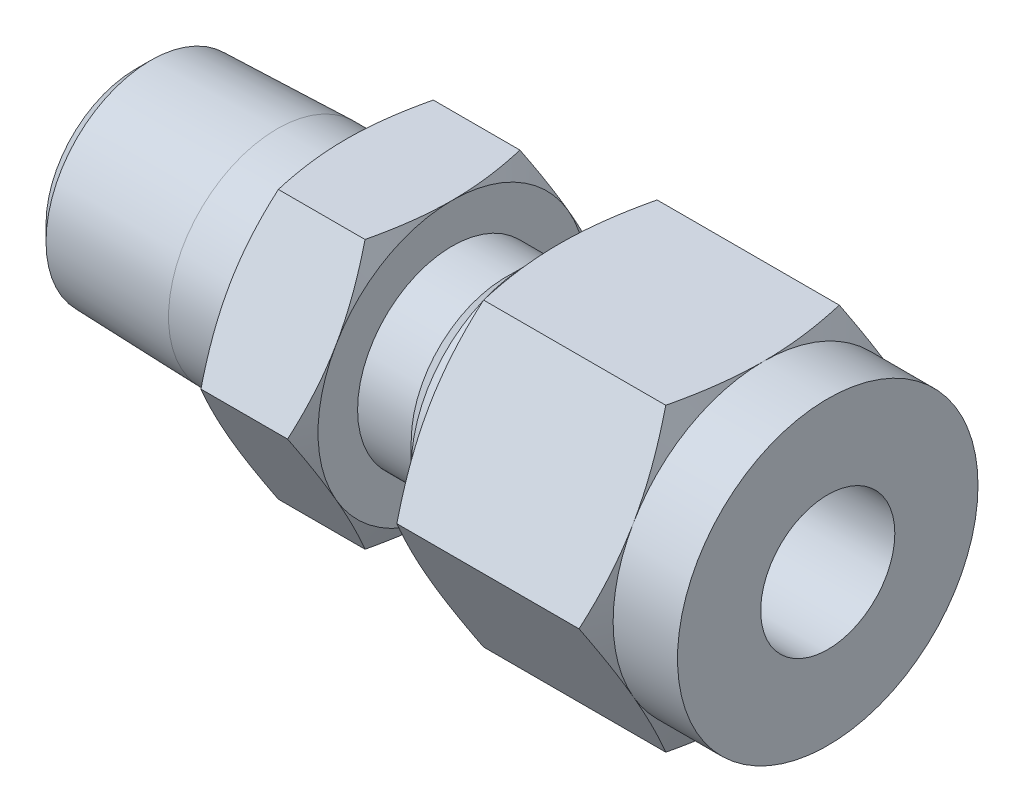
ISO-10303-21;
HEADER;
FILE_DESCRIPTION(('STEP AP214'),'2;1');
FILE_NAME('part.step','',(''),(''),'','','');
FILE_SCHEMA(('AUTOMOTIVE_DESIGN { 1 0 10303 214 1 1 1 1 }'));
ENDSEC;
DATA;
#1=APPLICATION_CONTEXT('core data for automotive mechanical design processes');
#2=APPLICATION_PROTOCOL_DEFINITION('international standard','automotive_design',2000,#1);
#3=PRODUCT_CONTEXT('',#1,'mechanical');
#4=PRODUCT('Part','Part','',(#3));
#5=PRODUCT_RELATED_PRODUCT_CATEGORY('part','',(#4));
#6=PRODUCT_DEFINITION_FORMATION('','',#4);
#7=PRODUCT_DEFINITION_CONTEXT('part definition',#1,'design');
#8=PRODUCT_DEFINITION('design','',#6,#7);
#9=PRODUCT_DEFINITION_SHAPE('','',#8);
#10=(LENGTH_UNIT() NAMED_UNIT(*) SI_UNIT(.MILLI.,.METRE.));
#11=(NAMED_UNIT(*) PLANE_ANGLE_UNIT() SI_UNIT($,.RADIAN.));
#12=(NAMED_UNIT(*) SI_UNIT($,.STERADIAN.) SOLID_ANGLE_UNIT());
#13=UNCERTAINTY_MEASURE_WITH_UNIT(LENGTH_MEASURE(1.E-05),#10,'distance_accuracy_value','');
#14=(GEOMETRIC_REPRESENTATION_CONTEXT(3) GLOBAL_UNCERTAINTY_ASSIGNED_CONTEXT((#13)) GLOBAL_UNIT_ASSIGNED_CONTEXT((#10,
#11,#12)) REPRESENTATION_CONTEXT('',''));
#15=CARTESIAN_POINT('',(0.,0.,0.));
#16=DIRECTION('',(0.,0.,1.));
#17=DIRECTION('',(1.,0.,0.));
#18=AXIS2_PLACEMENT_3D('',#15,#16,#17);
#19=CARTESIAN_POINT('',(9.96696,0.,0.));
#20=DIRECTION('',(1.,0.,0.));
#21=DIRECTION('',(0.,1.,0.));
#22=AXIS2_PLACEMENT_3D('',#19,#20,#21);
#23=PLANE('',#22);
#24=CARTESIAN_POINT('',(9.96695999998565,0.,0.));
#25=DIRECTION('',(1.,0.,0.));
#26=DIRECTION('',(0.,0.,-1.));
#27=AXIS2_PLACEMENT_3D('',#24,#25,#26);
#28=CIRCLE('',#27,6.34999999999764);
#29=CARTESIAN_POINT('',(9.9669599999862,6.34999999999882,0.));
#30=VERTEX_POINT('',#29);
#31=CARTESIAN_POINT('',(9.9669599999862,3.17499999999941,5.49926131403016));
#32=VERTEX_POINT('',#31);
#33=EDGE_CURVE('E560',#30,#32,#28,.T.);
#34=ORIENTED_EDGE('',*,*,#33,.F.);
#35=CARTESIAN_POINT('',(9.96695999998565,0.,0.));
#36=DIRECTION('',(1.,0.,0.));
#37=DIRECTION('',(0.,0.,-1.));
#38=AXIS2_PLACEMENT_3D('',#35,#36,#37);
#39=CIRCLE('',#38,6.34999999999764);
#40=CARTESIAN_POINT('',(9.9669599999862,3.17499999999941,-5.49926131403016));
#41=VERTEX_POINT('',#40);
#42=EDGE_CURVE('E546',#41,#30,#39,.T.);
#43=ORIENTED_EDGE('',*,*,#42,.F.);
#44=CARTESIAN_POINT('',(9.96695999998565,0.,0.));
#45=DIRECTION('',(1.,0.,0.));
#46=DIRECTION('',(0.,0.,-1.));
#47=AXIS2_PLACEMENT_3D('',#44,#45,#46);
#48=CIRCLE('',#47,6.34999999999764);
#49=CARTESIAN_POINT('',(9.9669599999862,-3.17499999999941,-5.49926131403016));
#50=VERTEX_POINT('',#49);
#51=EDGE_CURVE('E541',#50,#41,#48,.T.);
#52=ORIENTED_EDGE('',*,*,#51,.F.);
#53=CARTESIAN_POINT('',(9.96695999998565,0.,0.));
#54=DIRECTION('',(1.,0.,0.));
#55=DIRECTION('',(0.,0.,-1.));
#56=AXIS2_PLACEMENT_3D('',#53,#54,#55);
#57=CIRCLE('',#56,6.34999999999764);
#58=CARTESIAN_POINT('',(9.9669599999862,-6.34999999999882,0.));
#59=VERTEX_POINT('',#58);
#60=EDGE_CURVE('E536',#59,#50,#57,.T.);
#61=ORIENTED_EDGE('',*,*,#60,.F.);
#62=CARTESIAN_POINT('',(9.96695999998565,0.,0.));
#63=DIRECTION('',(1.,0.,0.));
#64=DIRECTION('',(0.,0.,-1.));
#65=AXIS2_PLACEMENT_3D('',#62,#63,#64);
#66=CIRCLE('',#65,6.34999999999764);
#67=CARTESIAN_POINT('',(9.9669599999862,-3.17499999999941,5.49926131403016));
#68=VERTEX_POINT('',#67);
#69=EDGE_CURVE('E314',#68,#59,#66,.T.);
#70=ORIENTED_EDGE('',*,*,#69,.F.);
#71=CARTESIAN_POINT('',(9.96695999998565,0.,0.));
#72=DIRECTION('',(1.,0.,0.));
#73=DIRECTION('',(0.,0.,-1.));
#74=AXIS2_PLACEMENT_3D('',#71,#72,#73);
#75=CIRCLE('',#74,6.34999999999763);
#76=EDGE_CURVE('E564',#32,#68,#75,.T.);
#77=ORIENTED_EDGE('',*,*,#76,.F.);
#78=EDGE_LOOP('',(#34,#43,#52,#61,#70,#77));
#79=FACE_BOUND('',#78,.T.);
#80=CARTESIAN_POINT('',(9.96696,0.,0.));
#81=DIRECTION('',(1.,0.,0.));
#82=DIRECTION('',(0.,1.,0.));
#83=AXIS2_PLACEMENT_3D('',#80,#81,#82);
#84=CIRCLE('',#83,5.1435);
#85=CARTESIAN_POINT('',(9.96696,5.1435,0.));
#86=VERTEX_POINT('',#85);
#87=EDGE_CURVE('E255',#86,#86,#84,.F.);
#88=ORIENTED_EDGE('',*,*,#87,.F.);
#89=EDGE_LOOP('',(#88));
#90=FACE_BOUND('',#89,.T.);
#91=ADVANCED_FACE('F50',(#79,#90),#23,.F.);
#92=CARTESIAN_POINT('',(14.986,0.,0.));
#93=DIRECTION('',(1.,0.,0.));
#94=DIRECTION('',(0.,1.,0.));
#95=AXIS2_PLACEMENT_3D('',#92,#93,#94);
#96=PLANE('',#95);
#97=CARTESIAN_POINT('',(14.986,0.,0.));
#98=DIRECTION('',(-1.,0.,0.));
#99=DIRECTION('',(0.,0.,1.));
#100=AXIS2_PLACEMENT_3D('',#97,#98,#99);
#101=CIRCLE('',#100,4.47675);
#102=CARTESIAN_POINT('',(14.986,0.,4.47675));
#103=VERTEX_POINT('',#102);
#104=EDGE_CURVE('E657',#103,#103,#101,.F.);
#105=ORIENTED_EDGE('',*,*,#104,.F.);
#106=EDGE_LOOP('',(#105));
#107=FACE_BOUND('',#106,.T.);
#108=CARTESIAN_POINT('',(14.985999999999,0.,0.));
#109=DIRECTION('',(-1.,0.,0.));
#110=DIRECTION('',(0.,0.,1.));
#111=AXIS2_PLACEMENT_3D('',#108,#109,#110);
#112=CIRCLE('',#111,6.34999999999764);
#113=CARTESIAN_POINT('',(14.9859999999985,3.17499999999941,5.49926131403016));
#114=VERTEX_POINT('',#113);
#115=CARTESIAN_POINT('',(14.9859999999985,-3.17499999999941,5.49926131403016));
#116=VERTEX_POINT('',#115);
#117=EDGE_CURVE('E1111',#114,#116,#112,.F.);
#118=ORIENTED_EDGE('',*,*,#117,.T.);
#119=CARTESIAN_POINT('',(14.985999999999,0.,0.));
#120=DIRECTION('',(-1.,0.,0.));
#121=DIRECTION('',(0.,0.,1.));
#122=AXIS2_PLACEMENT_3D('',#119,#120,#121);
#123=CIRCLE('',#122,6.34999999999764);
#124=CARTESIAN_POINT('',(14.9859999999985,-6.34999999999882,0.));
#125=VERTEX_POINT('',#124);
#126=EDGE_CURVE('E1119',#116,#125,#123,.F.);
#127=ORIENTED_EDGE('',*,*,#126,.T.);
#128=CARTESIAN_POINT('',(14.985999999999,0.,0.));
#129=DIRECTION('',(-1.,0.,0.));
#130=DIRECTION('',(0.,0.,1.));
#131=AXIS2_PLACEMENT_3D('',#128,#129,#130);
#132=CIRCLE('',#131,6.34999999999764);
#133=CARTESIAN_POINT('',(14.9859999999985,-3.17499999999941,-5.49926131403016));
#134=VERTEX_POINT('',#133);
#135=EDGE_CURVE('E195',#125,#134,#132,.F.);
#136=ORIENTED_EDGE('',*,*,#135,.T.);
#137=CARTESIAN_POINT('',(14.985999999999,0.,0.));
#138=DIRECTION('',(-1.,0.,0.));
#139=DIRECTION('',(0.,0.,1.));
#140=AXIS2_PLACEMENT_3D('',#137,#138,#139);
#141=CIRCLE('',#140,6.34999999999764);
#142=CARTESIAN_POINT('',(14.9859999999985,3.17499999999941,-5.49926131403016));
#143=VERTEX_POINT('',#142);
#144=EDGE_CURVE('E1129',#134,#143,#141,.F.);
#145=ORIENTED_EDGE('',*,*,#144,.T.);
#146=CARTESIAN_POINT('',(14.985999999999,0.,0.));
#147=DIRECTION('',(-1.,0.,0.));
#148=DIRECTION('',(0.,0.,1.));
#149=AXIS2_PLACEMENT_3D('',#146,#147,#148);
#150=CIRCLE('',#149,6.34999999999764);
#151=CARTESIAN_POINT('',(14.9859999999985,6.34999999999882,0.));
#152=VERTEX_POINT('',#151);
#153=EDGE_CURVE('E1124',#143,#152,#150,.F.);
#154=ORIENTED_EDGE('',*,*,#153,.T.);
#155=CARTESIAN_POINT('',(14.985999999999,0.,0.));
#156=DIRECTION('',(-1.,0.,0.));
#157=DIRECTION('',(0.,0.,1.));
#158=AXIS2_PLACEMENT_3D('',#155,#156,#157);
#159=CIRCLE('',#158,6.34999999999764);
#160=EDGE_CURVE('E1115',#152,#114,#159,.F.);
#161=ORIENTED_EDGE('',*,*,#160,.T.);
#162=EDGE_LOOP('',(#118,#127,#136,#145,#154,#161));
#163=FACE_BOUND('',#162,.T.);
#164=ADVANCED_FACE('F669',(#107,#163),#96,.T.);
#165=CARTESIAN_POINT('',(14.9860000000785,0.,0.));
#166=DIRECTION('',(-1.,0.,0.));
#167=DIRECTION('',(0.,0.,1.));
#168=AXIS2_PLACEMENT_3D('',#165,#166,#167);
#169=CONICAL_SURFACE('',#168,6.34999999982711,1.13446401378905);
#170=ORIENTED_EDGE('',*,*,#135,.F.);
#171=CARTESIAN_POINT('',(14.5279234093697,-6.35,-3.66617420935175));
#172=CARTESIAN_POINT('',(14.5980804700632,-6.35,-3.36537923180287));
#173=CARTESIAN_POINT('',(14.6621065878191,-6.35,-3.06296360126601));
#174=CARTESIAN_POINT('',(14.7748106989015,-6.35,-2.45636091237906));
#175=CARTESIAN_POINT('',(14.8235395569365,-6.35,-2.15218322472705));
#176=CARTESIAN_POINT('',(14.8832066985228,-6.35,-1.69403965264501));
#177=CARTESIAN_POINT('',(14.9008626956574,-6.35,-1.54094689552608));
#178=CARTESIAN_POINT('',(14.9313902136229,-6.35,-1.23428350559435));
#179=CARTESIAN_POINT('',(14.9442618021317,-6.35,-1.08071287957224));
#180=CARTESIAN_POINT('',(14.9650050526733,-6.35,-0.772717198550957));
#181=CARTESIAN_POINT('',(14.9728598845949,-6.35,-0.618291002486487));
#182=CARTESIAN_POINT('',(14.9833668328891,-6.35,-0.309244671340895));
#183=CARTESIAN_POINT('',(14.9860183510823,-6.35,-0.154624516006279));
#184=CARTESIAN_POINT('',(14.9859999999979,-6.35,0.));
#185=B_SPLINE_CURVE_WITH_KNOTS('',3,(#171,#172,#173,#174,#175,#176,#177,#178,#179,#180,#181,
#182,#183,#184),.UNSPECIFIED.,.F.,.F.,(4,2,2,2,2,2,4),(0.,0.926838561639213,1.85056183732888,
2.31281613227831,2.77506388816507,3.23885434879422,3.70269812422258),.UNSPECIFIED.);
#186=CARTESIAN_POINT('',(14.5279234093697,-6.34999999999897,-3.66617420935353));
#187=VERTEX_POINT('',#186);
#188=EDGE_CURVE('E647',#187,#125,#185,.T.);
#189=ORIENTED_EDGE('',*,*,#188,.F.);
#190=CARTESIAN_POINT('',(14.9859999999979,-3.175,-5.49926131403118));
#191=CARTESIAN_POINT('',(14.9860183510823,-3.30890875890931,-5.42194905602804));
#192=CARTESIAN_POINT('',(14.9833668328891,-3.44281374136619,-5.34463897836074));
#193=CARTESIAN_POINT('',(14.9728598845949,-3.71045571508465,-5.19011581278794));
#194=CARTESIAN_POINT('',(14.9650050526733,-3.84419272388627,-5.11290271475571));
#195=CARTESIAN_POINT('',(14.9442618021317,-4.11092480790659,-4.95890487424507));
#196=CARTESIAN_POINT('',(14.9313902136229,-4.24392087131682,-4.88211956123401));
#197=CARTESIAN_POINT('',(14.9008626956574,-4.50949915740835,-4.72878786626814));
#198=CARTESIAN_POINT('',(14.8832066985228,-4.64208137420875,-4.65224148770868));
#199=CARTESIAN_POINT('',(14.8235395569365,-5.03884534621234,-4.42316970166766));
#200=CARTESIAN_POINT('',(14.7748106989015,-5.30227095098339,-4.27108085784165));
#201=CARTESIAN_POINT('',(14.6621065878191,-5.82760428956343,-3.96777951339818));
#202=CARTESIAN_POINT('',(14.5980804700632,-6.08950390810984,-3.81657169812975));
#203=CARTESIAN_POINT('',(14.5279234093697,-6.34999999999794,-3.66617420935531));
#204=B_SPLINE_CURVE_WITH_KNOTS('',3,(#190,#191,#192,#193,#194,#195,#196,#197,#198,#199,#200,
#201,#202,#203),.UNSPECIFIED.,.F.,.F.,(4,2,2,2,2,2,4),(0.,0.463843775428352,0.927634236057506,
1.38988199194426,1.85213628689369,2.77585956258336,3.70269812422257),.UNSPECIFIED.);
#205=EDGE_CURVE('E377',#134,#187,#204,.T.);
#206=ORIENTED_EDGE('',*,*,#205,.F.);
#207=EDGE_LOOP('',(#170,#189,#206));
#208=FACE_BOUND('',#207,.T.);
#209=ADVANCED_FACE('F664',(#208),#169,.T.);
#210=CARTESIAN_POINT('',(14.9860000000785,0.,0.));
#211=DIRECTION('',(-1.,0.,0.));
#212=DIRECTION('',(0.,0.,1.));
#213=AXIS2_PLACEMENT_3D('',#210,#211,#212);
#214=CONICAL_SURFACE('',#213,6.34999999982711,1.13446401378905);
#215=ORIENTED_EDGE('',*,*,#144,.F.);
#216=CARTESIAN_POINT('',(14.5279234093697,-2.05853362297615E-12,-7.33234841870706));
#217=CARTESIAN_POINT('',(14.5980804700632,-0.260496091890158,-7.18195092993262));
#218=CARTESIAN_POINT('',(14.6621065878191,-0.522395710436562,-7.03074311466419));
#219=CARTESIAN_POINT('',(14.7748106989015,-1.04772904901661,-6.72744177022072));
#220=CARTESIAN_POINT('',(14.8235395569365,-1.31115465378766,-6.57535292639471));
#221=CARTESIAN_POINT('',(14.8832066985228,-1.70791862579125,-6.34628114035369));
#222=CARTESIAN_POINT('',(14.9008626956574,-1.84050084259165,-6.26973476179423));
#223=CARTESIAN_POINT('',(14.9313902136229,-2.10607912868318,-6.11640306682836));
#224=CARTESIAN_POINT('',(14.9442618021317,-2.23907519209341,-6.0396177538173));
#225=CARTESIAN_POINT('',(14.9650050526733,-2.50580727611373,-5.88561991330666));
#226=CARTESIAN_POINT('',(14.9728598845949,-2.63954428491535,-5.80840681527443));
#227=CARTESIAN_POINT('',(14.9833668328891,-2.90718625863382,-5.65388364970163));
#228=CARTESIAN_POINT('',(14.9860183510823,-3.04109124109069,-5.57657357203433));
#229=CARTESIAN_POINT('',(14.9859999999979,-3.175,-5.49926131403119));
#230=B_SPLINE_CURVE_WITH_KNOTS('',3,(#216,#217,#218,#219,#220,#221,#222,#223,#224,#225,#226,
#227,#228,#229),.UNSPECIFIED.,.F.,.F.,(4,2,2,2,2,2,4),(0.,0.926838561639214,1.85056183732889,
2.31281613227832,2.77506388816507,3.23885434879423,3.70269812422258),.UNSPECIFIED.);
#231=CARTESIAN_POINT('',(14.5279234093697,0.,-7.33234841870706));
#232=VERTEX_POINT('',#231);
#233=EDGE_CURVE('E1101',#232,#134,#230,.T.);
#234=ORIENTED_EDGE('',*,*,#233,.F.);
#235=CARTESIAN_POINT('',(14.9859999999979,3.175,-5.49926131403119));
#236=CARTESIAN_POINT('',(14.9860183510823,3.04109124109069,-5.57657357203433));
#237=CARTESIAN_POINT('',(14.9833668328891,2.90718625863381,-5.65388364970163));
#238=CARTESIAN_POINT('',(14.9728598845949,2.63954428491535,-5.80840681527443));
#239=CARTESIAN_POINT('',(14.9650050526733,2.50580727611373,-5.88561991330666));
#240=CARTESIAN_POINT('',(14.9442618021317,2.23907519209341,-6.0396177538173));
#241=CARTESIAN_POINT('',(14.9313902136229,2.10607912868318,-6.11640306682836));
#242=CARTESIAN_POINT('',(14.9008626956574,1.84050084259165,-6.26973476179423));
#243=CARTESIAN_POINT('',(14.8832066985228,1.70791862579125,-6.34628114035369));
#244=CARTESIAN_POINT('',(14.8235395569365,1.31115465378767,-6.57535292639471));
#245=CARTESIAN_POINT('',(14.7748106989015,1.04772904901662,-6.72744177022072));
#246=CARTESIAN_POINT('',(14.6621065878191,0.522395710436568,-7.03074311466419));
#247=CARTESIAN_POINT('',(14.5980804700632,0.260496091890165,-7.18195092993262));
#248=CARTESIAN_POINT('',(14.5279234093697,2.06604237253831E-12,-7.33234841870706));
#249=B_SPLINE_CURVE_WITH_KNOTS('',3,(#235,#236,#237,#238,#239,#240,#241,#242,#243,#244,#245,
#246,#247,#248),.UNSPECIFIED.,.F.,.F.,(4,2,2,2,2,2,4),(0.,0.463843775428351,0.927634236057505,
1.38988199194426,1.85213628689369,2.77585956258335,3.70269812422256),.UNSPECIFIED.);
#250=EDGE_CURVE('E1090',#143,#232,#249,.T.);
#251=ORIENTED_EDGE('',*,*,#250,.F.);
#252=EDGE_LOOP('',(#215,#234,#251));
#253=FACE_BOUND('',#252,.T.);
#254=ADVANCED_FACE('F668',(#253),#214,.T.);
#255=CARTESIAN_POINT('',(14.9860000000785,0.,0.));
#256=DIRECTION('',(-1.,0.,0.));
#257=DIRECTION('',(0.,0.,1.));
#258=AXIS2_PLACEMENT_3D('',#255,#256,#257);
#259=CONICAL_SURFACE('',#258,6.34999999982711,1.13446401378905);
#260=CARTESIAN_POINT('',(14.9859999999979,6.35,0.));
#261=CARTESIAN_POINT('',(14.9860183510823,6.35,-0.15462451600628));
#262=CARTESIAN_POINT('',(14.9833668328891,6.35,-0.309244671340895));
#263=CARTESIAN_POINT('',(14.9728598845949,6.35,-0.618291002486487));
#264=CARTESIAN_POINT('',(14.9650050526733,6.35,-0.772717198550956));
#265=CARTESIAN_POINT('',(14.9442618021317,6.35,-1.08071287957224));
#266=CARTESIAN_POINT('',(14.9313902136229,6.35,-1.23428350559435));
#267=CARTESIAN_POINT('',(14.9008626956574,6.35,-1.54094689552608));
#268=CARTESIAN_POINT('',(14.8832066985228,6.35,-1.69403965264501));
#269=CARTESIAN_POINT('',(14.8235395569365,6.35,-2.15218322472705));
#270=CARTESIAN_POINT('',(14.7748106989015,6.35,-2.45636091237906));
#271=CARTESIAN_POINT('',(14.6621065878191,6.35,-3.06296360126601));
#272=CARTESIAN_POINT('',(14.5980804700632,6.35,-3.36537923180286));
#273=CARTESIAN_POINT('',(14.5279234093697,6.35,-3.66617420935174));
#274=B_SPLINE_CURVE_WITH_KNOTS('',3,(#260,#261,#262,#263,#264,#265,#266,#267,#268,#269,#270,
#271,#272,#273),.UNSPECIFIED.,.F.,.F.,(4,2,2,2,2,2,4),(0.,0.463843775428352,0.927634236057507,
1.38988199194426,1.85213628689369,2.77585956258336,3.70269812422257),.UNSPECIFIED.);
#275=CARTESIAN_POINT('',(14.5279234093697,6.34999999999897,-3.66617420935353));
#276=VERTEX_POINT('',#275);
#277=EDGE_CURVE('E613',#152,#276,#274,.T.);
#278=ORIENTED_EDGE('',*,*,#277,.F.);
#279=ORIENTED_EDGE('',*,*,#153,.F.);
#280=CARTESIAN_POINT('',(14.5279234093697,6.34999999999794,-3.66617420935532));
#281=CARTESIAN_POINT('',(14.5980804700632,6.08950390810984,-3.81657169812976));
#282=CARTESIAN_POINT('',(14.6621065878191,5.82760428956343,-3.96777951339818));
#283=CARTESIAN_POINT('',(14.7748106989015,5.30227095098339,-4.27108085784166));
#284=CARTESIAN_POINT('',(14.8235395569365,5.03884534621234,-4.42316970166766));
#285=CARTESIAN_POINT('',(14.8832066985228,4.64208137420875,-4.65224148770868));
#286=CARTESIAN_POINT('',(14.9008626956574,4.50949915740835,-4.72878786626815));
#287=CARTESIAN_POINT('',(14.9313902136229,4.24392087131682,-4.88211956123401));
#288=CARTESIAN_POINT('',(14.9442618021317,4.11092480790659,-4.95890487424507));
#289=CARTESIAN_POINT('',(14.9650050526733,3.84419272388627,-5.11290271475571));
#290=CARTESIAN_POINT('',(14.9728598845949,3.71045571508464,-5.19011581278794));
#291=CARTESIAN_POINT('',(14.9833668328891,3.44281374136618,-5.34463897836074));
#292=CARTESIAN_POINT('',(14.9860183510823,3.30890875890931,-5.42194905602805));
#293=CARTESIAN_POINT('',(14.9859999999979,3.175,-5.49926131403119));
#294=B_SPLINE_CURVE_WITH_KNOTS('',3,(#280,#281,#282,#283,#284,#285,#286,#287,#288,#289,#290,
#291,#292,#293),.UNSPECIFIED.,.F.,.F.,(4,2,2,2,2,2,4),(0.,0.926838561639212,1.85056183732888,
2.31281613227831,2.77506388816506,3.23885434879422,3.70269812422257),.UNSPECIFIED.);
#295=EDGE_CURVE('E1093',#276,#143,#294,.T.);
#296=ORIENTED_EDGE('',*,*,#295,.F.);
#297=EDGE_LOOP('',(#278,#279,#296));
#298=FACE_BOUND('',#297,.T.);
#299=ADVANCED_FACE('F1241',(#298),#259,.T.);
#300=CARTESIAN_POINT('',(14.9860000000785,0.,0.));
#301=DIRECTION('',(-1.,0.,0.));
#302=DIRECTION('',(0.,0.,1.));
#303=AXIS2_PLACEMENT_3D('',#300,#301,#302);
#304=CONICAL_SURFACE('',#303,6.34999999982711,1.13446401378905);
#305=CARTESIAN_POINT('',(14.9859999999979,-6.35,0.));
#306=CARTESIAN_POINT('',(14.9860183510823,-6.35,0.154624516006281));
#307=CARTESIAN_POINT('',(14.9833668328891,-6.35,0.309244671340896));
#308=CARTESIAN_POINT('',(14.9728598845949,-6.35,0.618291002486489));
#309=CARTESIAN_POINT('',(14.9650050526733,-6.35,0.772717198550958));
#310=CARTESIAN_POINT('',(14.9442618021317,-6.35,1.08071287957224));
#311=CARTESIAN_POINT('',(14.9313902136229,-6.35,1.23428350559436));
#312=CARTESIAN_POINT('',(14.9008626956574,-6.35,1.54094689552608));
#313=CARTESIAN_POINT('',(14.8832066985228,-6.35,1.69403965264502));
#314=CARTESIAN_POINT('',(14.8235395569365,-6.35,2.15218322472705));
#315=CARTESIAN_POINT('',(14.7748106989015,-6.35,2.45636091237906));
#316=CARTESIAN_POINT('',(14.6621065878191,-6.35,3.06296360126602));
#317=CARTESIAN_POINT('',(14.5980804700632,-6.35,3.36537923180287));
#318=CARTESIAN_POINT('',(14.5279234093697,-6.35,3.66617420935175));
#319=B_SPLINE_CURVE_WITH_KNOTS('',3,(#305,#306,#307,#308,#309,#310,#311,#312,#313,#314,#315,
#316,#317,#318),.UNSPECIFIED.,.F.,.F.,(4,2,2,2,2,2,4),(0.,0.463843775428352,0.927634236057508,
1.38988199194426,1.85213628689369,2.77585956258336,3.70269812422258),.UNSPECIFIED.);
#320=CARTESIAN_POINT('',(14.5279234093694,-6.34999999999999,3.66617420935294));
#321=VERTEX_POINT('',#320);
#322=EDGE_CURVE('E656',#125,#321,#319,.T.);
#323=ORIENTED_EDGE('',*,*,#322,.F.);
#324=ORIENTED_EDGE('',*,*,#126,.F.);
#325=CARTESIAN_POINT('',(14.5279234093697,-6.34999999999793,3.66617420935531));
#326=CARTESIAN_POINT('',(14.5980804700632,-6.08950390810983,3.81657169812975));
#327=CARTESIAN_POINT('',(14.6621065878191,-5.82760428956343,3.96777951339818));
#328=CARTESIAN_POINT('',(14.7748106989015,-5.30227095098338,4.27108085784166));
#329=CARTESIAN_POINT('',(14.8235395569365,-5.03884534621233,4.42316970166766));
#330=CARTESIAN_POINT('',(14.8832066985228,-4.64208137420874,4.65224148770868));
#331=CARTESIAN_POINT('',(14.9008626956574,-4.50949915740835,4.72878786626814));
#332=CARTESIAN_POINT('',(14.9313902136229,-4.24392087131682,4.88211956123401));
#333=CARTESIAN_POINT('',(14.9442618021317,-4.11092480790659,4.95890487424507));
#334=CARTESIAN_POINT('',(14.9650050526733,-3.84419272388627,5.11290271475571));
#335=CARTESIAN_POINT('',(14.9728598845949,-3.71045571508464,5.19011581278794));
#336=CARTESIAN_POINT('',(14.9833668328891,-3.44281374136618,5.34463897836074));
#337=CARTESIAN_POINT('',(14.9860183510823,-3.30890875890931,5.42194905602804));
#338=CARTESIAN_POINT('',(14.9859999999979,-3.175,5.49926131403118));
#339=B_SPLINE_CURVE_WITH_KNOTS('',3,(#325,#326,#327,#328,#329,#330,#331,#332,#333,#334,#335,
#336,#337,#338),.UNSPECIFIED.,.F.,.F.,(4,2,2,2,2,2,4),(0.,0.926838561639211,1.85056183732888,
2.31281613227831,2.77506388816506,3.23885434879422,3.70269812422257),.UNSPECIFIED.);
#340=EDGE_CURVE('E456',#321,#116,#339,.T.);
#341=ORIENTED_EDGE('',*,*,#340,.F.);
#342=EDGE_LOOP('',(#323,#324,#341));
#343=FACE_BOUND('',#342,.T.);
#344=ADVANCED_FACE('F625',(#343),#304,.T.);
#345=CARTESIAN_POINT('',(14.9860000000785,0.,0.));
#346=DIRECTION('',(-1.,0.,0.));
#347=DIRECTION('',(0.,0.,1.));
#348=AXIS2_PLACEMENT_3D('',#345,#346,#347);
#349=CONICAL_SURFACE('',#348,6.34999999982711,1.13446401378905);
#350=CARTESIAN_POINT('',(14.9859999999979,3.175,5.49926131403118));
#351=CARTESIAN_POINT('',(14.9860183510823,3.30890875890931,5.42194905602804));
#352=CARTESIAN_POINT('',(14.9833668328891,3.44281374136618,5.34463897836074));
#353=CARTESIAN_POINT('',(14.9728598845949,3.71045571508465,5.19011581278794));
#354=CARTESIAN_POINT('',(14.9650050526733,3.84419272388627,5.11290271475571));
#355=CARTESIAN_POINT('',(14.9442618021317,4.11092480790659,4.95890487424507));
#356=CARTESIAN_POINT('',(14.9313902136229,4.24392087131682,4.88211956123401));
#357=CARTESIAN_POINT('',(14.9008626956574,4.50949915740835,4.72878786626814));
#358=CARTESIAN_POINT('',(14.8832066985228,4.64208137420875,4.65224148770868));
#359=CARTESIAN_POINT('',(14.8235395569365,5.03884534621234,4.42316970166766));
#360=CARTESIAN_POINT('',(14.7748106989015,5.30227095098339,4.27108085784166));
#361=CARTESIAN_POINT('',(14.6621065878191,5.82760428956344,3.96777951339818));
#362=CARTESIAN_POINT('',(14.5980804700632,6.08950390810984,3.81657169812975));
#363=CARTESIAN_POINT('',(14.5279234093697,6.34999999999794,3.66617420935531));
#364=B_SPLINE_CURVE_WITH_KNOTS('',3,(#350,#351,#352,#353,#354,#355,#356,#357,#358,#359,#360,
#361,#362,#363),.UNSPECIFIED.,.F.,.F.,(4,2,2,2,2,2,4),(0.,0.463843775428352,0.927634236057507,
1.38988199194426,1.85213628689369,2.77585956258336,3.70269812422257),.UNSPECIFIED.);
#365=CARTESIAN_POINT('',(14.5279234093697,6.34999999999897,3.66617420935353));
#366=VERTEX_POINT('',#365);
#367=EDGE_CURVE('E630',#114,#366,#364,.T.);
#368=ORIENTED_EDGE('',*,*,#367,.F.);
#369=ORIENTED_EDGE('',*,*,#160,.F.);
#370=CARTESIAN_POINT('',(14.5279234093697,6.35,3.66617420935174));
#371=CARTESIAN_POINT('',(14.5980804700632,6.35,3.36537923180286));
#372=CARTESIAN_POINT('',(14.6621065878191,6.35,3.06296360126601));
#373=CARTESIAN_POINT('',(14.7748106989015,6.35,2.45636091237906));
#374=CARTESIAN_POINT('',(14.8235395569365,6.35,2.15218322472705));
#375=CARTESIAN_POINT('',(14.8832066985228,6.35,1.69403965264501));
#376=CARTESIAN_POINT('',(14.9008626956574,6.35,1.54094689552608));
#377=CARTESIAN_POINT('',(14.9313902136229,6.35,1.23428350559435));
#378=CARTESIAN_POINT('',(14.9442618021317,6.35,1.08071287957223));
#379=CARTESIAN_POINT('',(14.9650050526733,6.35,0.772717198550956));
#380=CARTESIAN_POINT('',(14.9728598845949,6.35,0.618291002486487));
#381=CARTESIAN_POINT('',(14.9833668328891,6.35,0.309244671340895));
#382=CARTESIAN_POINT('',(14.9860183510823,6.35,0.15462451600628));
#383=CARTESIAN_POINT('',(14.9859999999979,6.35,0.));
#384=B_SPLINE_CURVE_WITH_KNOTS('',3,(#370,#371,#372,#373,#374,#375,#376,#377,#378,#379,#380,
#381,#382,#383),.UNSPECIFIED.,.F.,.F.,(4,2,2,2,2,2,4),(0.,0.926838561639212,1.85056183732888,
2.31281613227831,2.77506388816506,3.23885434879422,3.70269812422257),.UNSPECIFIED.);
#385=EDGE_CURVE('E597',#366,#152,#384,.T.);
#386=ORIENTED_EDGE('',*,*,#385,.F.);
#387=EDGE_LOOP('',(#368,#369,#386));
#388=FACE_BOUND('',#387,.T.);
#389=ADVANCED_FACE('F621',(#388),#349,.T.);
#390=CARTESIAN_POINT('',(14.9860000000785,0.,0.));
#391=DIRECTION('',(-1.,0.,0.));
#392=DIRECTION('',(0.,0.,1.));
#393=AXIS2_PLACEMENT_3D('',#390,#391,#392);
#394=CONICAL_SURFACE('',#393,6.34999999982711,1.13446401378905);
#395=CARTESIAN_POINT('',(14.9859999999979,-3.175,5.49926131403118));
#396=CARTESIAN_POINT('',(14.9860183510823,-3.04109124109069,5.57657357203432));
#397=CARTESIAN_POINT('',(14.9833668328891,-2.90718625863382,5.65388364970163));
#398=CARTESIAN_POINT('',(14.9728598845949,-2.63954428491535,5.80840681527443));
#399=CARTESIAN_POINT('',(14.9650050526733,-2.50580727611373,5.88561991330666));
#400=CARTESIAN_POINT('',(14.9442618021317,-2.23907519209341,6.0396177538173));
#401=CARTESIAN_POINT('',(14.9313902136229,-2.10607912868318,6.11640306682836));
#402=CARTESIAN_POINT('',(14.9008626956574,-1.84050084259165,6.26973476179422));
#403=CARTESIAN_POINT('',(14.8832066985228,-1.70791862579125,6.34628114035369));
#404=CARTESIAN_POINT('',(14.8235395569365,-1.31115465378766,6.57535292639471));
#405=CARTESIAN_POINT('',(14.7748106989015,-1.04772904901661,6.72744177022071));
#406=CARTESIAN_POINT('',(14.6621065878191,-0.522395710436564,7.03074311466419));
#407=CARTESIAN_POINT('',(14.5980804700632,-0.26049609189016,7.18195092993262));
#408=CARTESIAN_POINT('',(14.5279234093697,-2.06110591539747E-12,7.33234841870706));
#409=B_SPLINE_CURVE_WITH_KNOTS('',3,(#395,#396,#397,#398,#399,#400,#401,#402,#403,#404,#405,
#406,#407,#408),.UNSPECIFIED.,.F.,.F.,(4,2,2,2,2,2,4),(0.,0.463843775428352,0.927634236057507,
1.38988199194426,1.85213628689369,2.77585956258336,3.70269812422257),.UNSPECIFIED.);
#410=CARTESIAN_POINT('',(14.5279234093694,-1.03016024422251E-12,7.33234841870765));
#411=VERTEX_POINT('',#410);
#412=EDGE_CURVE('E606',#116,#411,#409,.T.);
#413=ORIENTED_EDGE('',*,*,#412,.F.);
#414=ORIENTED_EDGE('',*,*,#117,.F.);
#415=CARTESIAN_POINT('',(14.5279234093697,2.06272850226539E-12,7.33234841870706));
#416=CARTESIAN_POINT('',(14.5980804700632,0.260496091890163,7.18195092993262));
#417=CARTESIAN_POINT('',(14.6621065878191,0.522395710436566,7.03074311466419));
#418=CARTESIAN_POINT('',(14.7748106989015,1.04772904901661,6.72744177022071));
#419=CARTESIAN_POINT('',(14.8235395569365,1.31115465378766,6.57535292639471));
#420=CARTESIAN_POINT('',(14.8832066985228,1.70791862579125,6.34628114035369));
#421=CARTESIAN_POINT('',(14.9008626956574,1.84050084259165,6.26973476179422));
#422=CARTESIAN_POINT('',(14.9313902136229,2.10607912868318,6.11640306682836));
#423=CARTESIAN_POINT('',(14.9442618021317,2.23907519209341,6.0396177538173));
#424=CARTESIAN_POINT('',(14.9650050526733,2.50580727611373,5.88561991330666));
#425=CARTESIAN_POINT('',(14.9728598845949,2.63954428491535,5.80840681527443));
#426=CARTESIAN_POINT('',(14.9833668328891,2.90718625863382,5.65388364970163));
#427=CARTESIAN_POINT('',(14.9860183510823,3.04109124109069,5.57657357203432));
#428=CARTESIAN_POINT('',(14.9859999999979,3.175,5.49926131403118));
#429=B_SPLINE_CURVE_WITH_KNOTS('',3,(#415,#416,#417,#418,#419,#420,#421,#422,#423,#424,#425,
#426,#427,#428),.UNSPECIFIED.,.F.,.F.,(4,2,2,2,2,2,4),(0.,0.926838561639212,1.85056183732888,
2.31281613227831,2.77506388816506,3.23885434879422,3.70269812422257),.UNSPECIFIED.);
#430=EDGE_CURVE('E321',#411,#114,#429,.T.);
#431=ORIENTED_EDGE('',*,*,#430,.F.);
#432=EDGE_LOOP('',(#413,#414,#431));
#433=FACE_BOUND('',#432,.T.);
#434=ADVANCED_FACE('F624',(#433),#394,.T.);
#435=CARTESIAN_POINT('',(16.256,0.,0.));
#436=DIRECTION('',(-1.,0.,0.));
#437=DIRECTION('',(0.,0.,1.));
#438=AXIS2_PLACEMENT_3D('',#435,#436,#437);
#439=CYLINDRICAL_SURFACE('',#438,4.47675);
#440=ORIENTED_EDGE('',*,*,#104,.T.);
#441=EDGE_LOOP('',(#440));
#442=FACE_BOUND('',#441,.T.);
#443=CARTESIAN_POINT('',(17.5259999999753,0.,0.));
#444=DIRECTION('',(1.,0.,0.));
#445=DIRECTION('',(0.,0.,1.));
#446=AXIS2_PLACEMENT_3D('',#443,#444,#445);
#447=CIRCLE('',#446,4.47674999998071);
#448=CARTESIAN_POINT('',(17.5259999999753,0.,4.47674999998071));
#449=VERTEX_POINT('',#448);
#450=EDGE_CURVE('E435',#449,#449,#447,.T.);
#451=ORIENTED_EDGE('',*,*,#450,.F.);
#452=EDGE_LOOP('',(#451));
#453=FACE_BOUND('',#452,.T.);
#454=ADVANCED_FACE('F1266',(#442,#453),#439,.T.);
#455=CARTESIAN_POINT('',(9.96696,-6.35,-3.66617420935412));
#456=DIRECTION('',(0.,-1.,0.));
#457=DIRECTION('',(0.,0.,-1.));
#458=AXIS2_PLACEMENT_3D('',#455,#456,#457);
#459=PLANE('',#458);
#460=CARTESIAN_POINT('',(9.96695999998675,-6.35,0.));
#461=CARTESIAN_POINT('',(9.96694164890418,-6.35,-0.154624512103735));
#462=CARTESIAN_POINT('',(9.96959316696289,-6.35,-0.309244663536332));
#463=CARTESIAN_POINT('',(9.98010011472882,-6.35,-0.618290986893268));
#464=CARTESIAN_POINT('',(9.98795494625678,-6.35,-0.772717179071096));
#465=CARTESIAN_POINT('',(10.0086981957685,-6.35,-1.08071285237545));
#466=CARTESIAN_POINT('',(10.0215697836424,-6.35,-1.23428347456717));
#467=CARTESIAN_POINT('',(10.0520973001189,-6.35,-1.54094685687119));
#468=CARTESIAN_POINT('',(10.0697532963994,-6.35,-1.69403961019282));
#469=CARTESIAN_POINT('',(10.1294204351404,-6.35,-2.15218317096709));
#470=CARTESIAN_POINT('',(10.1781492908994,-6.35,-2.45636085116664));
#471=CARTESIAN_POINT('',(10.2908533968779,-6.35,-3.06296352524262));
#472=CARTESIAN_POINT('',(10.3548795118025,-6.35,-3.36537914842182));
#473=CARTESIAN_POINT('',(10.4250365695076,-6.35,-3.66617411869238));
#474=B_SPLINE_CURVE_WITH_KNOTS('',3,(#460,#461,#462,#463,#464,#465,#466,#467,#468,#469,#470,
#471,#472,#473),.UNSPECIFIED.,.F.,.F.,(4,2,2,2,2,2,4),(0.,0.463843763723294,0.927634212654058,
1.38988195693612,1.85213624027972,2.7758594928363,3.70269803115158),.UNSPECIFIED.);
#475=CARTESIAN_POINT('',(10.4250365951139,-6.35000001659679,-3.66617419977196));
#476=VERTEX_POINT('',#475);
#477=EDGE_CURVE('E396',#59,#476,#474,.T.);
#478=ORIENTED_EDGE('',*,*,#477,.T.);
#479=DIRECTION('',(1.,0.,0.));
#480=VECTOR('',#479,1.);
#481=CARTESIAN_POINT('',(9.96696,-6.35,-3.66617420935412));
#482=LINE('',#481,#480);
#483=EDGE_CURVE('E579',#187,#476,#482,.F.);
#484=ORIENTED_EDGE('',*,*,#483,.F.);
#485=ORIENTED_EDGE('',*,*,#188,.T.);
#486=ORIENTED_EDGE('',*,*,#322,.T.);
#487=DIRECTION('',(1.,0.,0.));
#488=VECTOR('',#487,1.);
#489=CARTESIAN_POINT('',(9.96696,-6.34999999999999,3.66617420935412));
#490=LINE('',#489,#488);
#491=CARTESIAN_POINT('',(10.425036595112,-6.34999999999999,3.66617422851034));
#492=VERTEX_POINT('',#491);
#493=EDGE_CURVE('E1075',#492,#321,#490,.T.);
#494=ORIENTED_EDGE('',*,*,#493,.F.);
#495=CARTESIAN_POINT('',(10.425036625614,-6.34999996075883,3.66617424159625));
#496=CARTESIAN_POINT('',(10.3548795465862,-6.34999998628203,3.36537926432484));
#497=CARTESIAN_POINT('',(10.2908534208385,-6.34999999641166,3.06296363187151));
#498=CARTESIAN_POINT('',(10.1781493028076,-6.35000000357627,2.45636093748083));
#499=CARTESIAN_POINT('',(10.1294204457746,-6.35000000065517,2.15218324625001));
#500=CARTESIAN_POINT('',(10.0697533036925,-6.34999999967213,1.69403966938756));
#501=CARTESIAN_POINT('',(10.0520973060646,-6.34999999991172,1.54094691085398));
#502=CARTESIAN_POINT('',(10.0215697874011,-6.35000000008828,1.23428351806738));
#503=CARTESIAN_POINT('',(10.0086981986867,-6.35000000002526,1.08071289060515));
#504=CARTESIAN_POINT('',(9.98795494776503,-6.34999999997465,0.772717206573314));
#505=CARTESIAN_POINT('',(9.98010011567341,-6.34999999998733,0.618291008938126));
#506=CARTESIAN_POINT('',(9.96959316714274,-6.35000000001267,0.309244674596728));
#507=CARTESIAN_POINT('',(9.96694164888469,-6.35000000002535,0.154624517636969));
#508=CARTESIAN_POINT('',(9.96695999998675,-6.35,0.));
#509=B_SPLINE_CURVE_WITH_KNOTS('',3,(#495,#496,#497,#498,#499,#500,#501,#502,#503,#504,#505,
#506,#507,#508),.UNSPECIFIED.,.F.,.F.,(4,2,2,2,2,2,4),(0.,0.926838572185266,1.85056185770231,
2.31281615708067,2.77506391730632,3.23885438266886,3.70269816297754),.UNSPECIFIED.);
#510=EDGE_CURVE('E418',#492,#59,#509,.T.);
#511=ORIENTED_EDGE('',*,*,#510,.T.);
#512=EDGE_LOOP('',(#478,#484,#485,#486,#494,#511));
#513=FACE_BOUND('',#512,.T.);
#514=ADVANCED_FACE('F369',(#513),#459,.T.);
#515=CARTESIAN_POINT('',(9.96696,0.,-7.33234841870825));
#516=DIRECTION('',(0.,-0.5,-0.866025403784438));
#517=DIRECTION('',(0.,0.866025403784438,-0.5));
#518=AXIS2_PLACEMENT_3D('',#515,#516,#517);
#519=PLANE('',#518);
#520=CARTESIAN_POINT('',(9.96695999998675,-3.175,-5.49926131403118));
#521=CARTESIAN_POINT('',(9.96694164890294,-3.04109124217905,-5.57657357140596));
#522=CARTESIAN_POINT('',(9.96959316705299,-2.90718626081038,-5.65388364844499));
#523=CARTESIAN_POINT('',(9.98010011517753,-2.63954428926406,-5.8084068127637));
#524=CARTESIAN_POINT('',(9.9879549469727,-2.50580728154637,-5.88561991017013));
#525=CARTESIAN_POINT('',(10.0086981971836,-2.23907519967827,-6.03961774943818));
#526=CARTESIAN_POINT('',(10.0215697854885,-2.10607913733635,-6.11640306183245));
#527=CARTESIAN_POINT('',(10.0520973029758,-1.84050085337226,-6.26973475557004));
#528=CARTESIAN_POINT('',(10.0697532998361,-1.70791863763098,-6.34628113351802));
#529=CARTESIAN_POINT('',(10.1294204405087,-1.31115466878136,-6.57535291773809));
#530=CARTESIAN_POINT('',(10.1781492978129,-1.04772906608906,-6.72744176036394));
#531=CARTESIAN_POINT('',(10.2908534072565,-0.522395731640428,-7.03074310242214));
#532=CARTESIAN_POINT('',(10.3548795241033,-0.260496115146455,-7.18195091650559));
#533=CARTESIAN_POINT('',(10.4250365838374,-2.52887753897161E-08,-7.33234840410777));
#534=B_SPLINE_CURVE_WITH_KNOTS('',3,(#520,#521,#522,#523,#524,#525,#526,#527,#528,#529,#530,
#531,#532,#533),.UNSPECIFIED.,.F.,.F.,(4,2,2,2,2,2,4),(0.,0.463843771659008,0.92763422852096,
1.38988198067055,1.85213627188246,2.77585954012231,3.70269809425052),.UNSPECIFIED.);
#535=CARTESIAN_POINT('',(10.4250365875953,1.13304456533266E-08,-7.33234841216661));
#536=VERTEX_POINT('',#535);
#537=EDGE_CURVE('E332',#50,#536,#534,.T.);
#538=ORIENTED_EDGE('',*,*,#537,.T.);
#539=DIRECTION('',(1.,0.,0.));
#540=VECTOR('',#539,1.);
#541=CARTESIAN_POINT('',(9.96696,0.,-7.33234841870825));
#542=LINE('',#541,#540);
#543=EDGE_CURVE('E1087',#232,#536,#542,.F.);
#544=ORIENTED_EDGE('',*,*,#543,.F.);
#545=ORIENTED_EDGE('',*,*,#233,.T.);
#546=ORIENTED_EDGE('',*,*,#205,.T.);
#547=ORIENTED_EDGE('',*,*,#483,.T.);
#548=CARTESIAN_POINT('',(10.425036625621,-6.35000000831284,-3.66617415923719));
#549=CARTESIAN_POINT('',(10.3548795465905,-6.08950392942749,-3.81657166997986));
#550=CARTESIAN_POINT('',(10.2908534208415,-5.8276043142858,-3.96777949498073));
#551=CARTESIAN_POINT('',(10.1781493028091,-5.30227097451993,-4.27108084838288));
#552=CARTESIAN_POINT('',(10.1294204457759,-5.0388453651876,-4.42316969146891));
#553=CARTESIAN_POINT('',(10.0697533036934,-4.64208138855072,-4.6522414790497));
#554=CARTESIAN_POINT('',(10.0520973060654,-4.50949917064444,-4.72878785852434));
#555=CARTESIAN_POINT('',(10.0215697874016,-4.24392088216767,-4.88211955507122));
#556=CARTESIAN_POINT('',(10.0086981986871,-4.11092481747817,-4.95890486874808));
#557=CARTESIAN_POINT('',(9.98795494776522,-3.84419273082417,-5.11290271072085));
#558=CARTESIAN_POINT('',(9.98010011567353,-3.710455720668,-5.19011580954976));
#559=CARTESIAN_POINT('',(9.96959316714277,-3.44281374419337,-5.3446389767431));
#560=CARTESIAN_POINT('',(9.96694164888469,-3.30890876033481,-5.42194905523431));
#561=CARTESIAN_POINT('',(9.96695999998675,-3.175,-5.49926131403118));
#562=B_SPLINE_CURVE_WITH_KNOTS('',3,(#548,#549,#550,#551,#552,#553,#554,#555,#556,#557,#558,
#559,#560,#561),.UNSPECIFIED.,.F.,.F.,(4,2,2,2,2,2,4),(0.,0.926838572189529,1.85056185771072,
2.3128161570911,2.77506391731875,3.23885438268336,3.70269816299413),.UNSPECIFIED.);
#563=EDGE_CURVE('E387',#476,#50,#562,.T.);
#564=ORIENTED_EDGE('',*,*,#563,.T.);
#565=EDGE_LOOP('',(#538,#544,#545,#546,#547,#564));
#566=FACE_BOUND('',#565,.T.);
#567=ADVANCED_FACE('F364',(#566),#519,.T.);
#568=CARTESIAN_POINT('',(9.96696,6.35,-3.66617420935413));
#569=DIRECTION('',(0.,0.5,-0.866025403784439));
#570=DIRECTION('',(0.,0.866025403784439,0.5));
#571=AXIS2_PLACEMENT_3D('',#568,#569,#570);
#572=PLANE('',#571);
#573=CARTESIAN_POINT('',(9.96695999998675,3.175,-5.49926131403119));
#574=CARTESIAN_POINT('',(9.9669416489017,3.30890876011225,-5.42194905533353));
#575=CARTESIAN_POINT('',(9.96959316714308,3.4428137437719,-5.3446389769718));
#576=CARTESIAN_POINT('',(9.98010011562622,3.71045571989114,-5.19011581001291));
#577=CARTESIAN_POINT('',(9.9879549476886,3.84419272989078,-5.11290271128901));
#578=CARTESIAN_POINT('',(10.0086981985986,4.1109248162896,-4.95890486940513));
#579=CARTESIAN_POINT('',(10.0215697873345,4.24392088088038,-4.88211955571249));
#580=CARTESIAN_POINT('',(10.0520973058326,4.50949916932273,-4.72878785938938));
#581=CARTESIAN_POINT('',(10.0697533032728,4.64208138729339,-4.65224148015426));
#582=CARTESIAN_POINT('',(10.1294204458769,5.03884536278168,-4.42316969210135));
#583=CARTESIAN_POINT('',(10.1781493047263,5.30227096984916,-4.2710808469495));
#584=CARTESIAN_POINT('',(10.2908534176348,5.82760431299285,-3.9677794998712));
#585=CARTESIAN_POINT('',(10.3548795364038,6.0895039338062,-3.81657168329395));
#586=CARTESIAN_POINT('',(10.4250365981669,6.35000002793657,-3.66617419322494));
#587=B_SPLINE_CURVE_WITH_KNOTS('',3,(#573,#574,#575,#576,#577,#578,#579,#580,#581,#582,#583,
#584,#585,#586),.UNSPECIFIED.,.F.,.F.,(4,2,2,2,2,2,4),(0.,0.463843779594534,0.927634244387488,
1.38988200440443,1.85213630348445,2.77585958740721,3.70269815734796),.UNSPECIFIED.);
#588=CARTESIAN_POINT('',(10.4250365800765,6.35,-3.66617416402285));
#589=VERTEX_POINT('',#588);
#590=EDGE_CURVE('E515',#41,#589,#587,.T.);
#591=ORIENTED_EDGE('',*,*,#590,.T.);
#592=DIRECTION('',(1.,0.,0.));
#593=VECTOR('',#592,1.);
#594=CARTESIAN_POINT('',(9.96696,6.35,-3.66617420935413));
#595=LINE('',#594,#593);
#596=EDGE_CURVE('E607',#276,#589,#595,.F.);
#597=ORIENTED_EDGE('',*,*,#596,.F.);
#598=ORIENTED_EDGE('',*,*,#295,.T.);
#599=ORIENTED_EDGE('',*,*,#250,.T.);
#600=ORIENTED_EDGE('',*,*,#543,.T.);
#601=CARTESIAN_POINT('',(10.4250365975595,1.54808449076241E-08,-7.33234838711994));
#602=CARTESIAN_POINT('',(10.3548795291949,0.260496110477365,-7.18195091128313));
#603=CARTESIAN_POINT('',(10.2908534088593,0.522395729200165,-7.03074310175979));
#604=CARTESIAN_POINT('',(10.1781492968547,1.04772906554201,-6.72744176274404));
#605=CARTESIAN_POINT('',(10.1294204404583,1.31115466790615,-6.57535291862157));
#606=CARTESIAN_POINT('',(10.0697533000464,1.70791863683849,-6.34628113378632));
#607=CARTESIAN_POINT('',(10.0520973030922,1.84050085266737,-6.26973475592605));
#608=CARTESIAN_POINT('',(10.021569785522,2.10607913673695,-6.11640306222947));
#609=CARTESIAN_POINT('',(10.0086981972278,2.23907519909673,-6.03961774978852));
#610=CARTESIAN_POINT('',(9.987954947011,2.5058072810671,-5.8856199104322));
#611=CARTESIAN_POINT('',(9.98010011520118,2.63954428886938,-5.80840681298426));
#612=CARTESIAN_POINT('',(9.96959316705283,2.90718626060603,-5.65388364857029));
#613=CARTESIAN_POINT('',(9.96694164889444,3.04109124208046,-5.57657357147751));
#614=CARTESIAN_POINT('',(9.96695999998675,3.175,-5.49926131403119));
#615=B_SPLINE_CURVE_WITH_KNOTS('',3,(#601,#602,#603,#604,#605,#606,#607,#608,#609,#610,#611,
#612,#613,#614),.UNSPECIFIED.,.F.,.F.,(4,2,2,2,2,2,4),(0.,0.926838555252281,1.85056182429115,
2.31281611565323,2.77506386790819,3.23885432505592,3.70269809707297),.UNSPECIFIED.);
#616=EDGE_CURVE('E345',#536,#41,#615,.T.);
#617=ORIENTED_EDGE('',*,*,#616,.T.);
#618=EDGE_LOOP('',(#591,#597,#598,#599,#600,#617));
#619=FACE_BOUND('',#618,.T.);
#620=ADVANCED_FACE('F368',(#619),#572,.T.);
#621=CARTESIAN_POINT('',(9.96696,6.35,0.));
#622=DIRECTION('',(0.,1.,0.));
#623=DIRECTION('',(0.,0.,1.));
#624=AXIS2_PLACEMENT_3D('',#621,#622,#623);
#625=PLANE('',#624);
#626=DIRECTION('',(1.,0.,0.));
#627=VECTOR('',#626,1.);
#628=CARTESIAN_POINT('',(9.96696,6.35,3.66617420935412));
#629=LINE('',#628,#627);
#630=CARTESIAN_POINT('',(10.4250365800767,6.34999996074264,3.66617423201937));
#631=VERTEX_POINT('',#630);
#632=EDGE_CURVE('E322',#366,#631,#629,.F.);
#633=ORIENTED_EDGE('',*,*,#632,.F.);
#634=ORIENTED_EDGE('',*,*,#385,.T.);
#635=ORIENTED_EDGE('',*,*,#277,.T.);
#636=ORIENTED_EDGE('',*,*,#596,.T.);
#637=CARTESIAN_POINT('',(10.4250365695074,6.35,-3.66617411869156));
#638=CARTESIAN_POINT('',(10.3548795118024,6.35,-3.36537914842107));
#639=CARTESIAN_POINT('',(10.2908533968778,6.35,-3.06296352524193));
#640=CARTESIAN_POINT('',(10.1781492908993,6.35,-2.45636085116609));
#641=CARTESIAN_POINT('',(10.1294204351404,6.35,-2.15218317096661));
#642=CARTESIAN_POINT('',(10.0697532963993,6.35,-1.69403961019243));
#643=CARTESIAN_POINT('',(10.0520973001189,6.35,-1.54094685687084));
#644=CARTESIAN_POINT('',(10.0215697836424,6.35,-1.23428347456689));
#645=CARTESIAN_POINT('',(10.0086981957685,6.35,-1.08071285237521));
#646=CARTESIAN_POINT('',(9.98795494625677,6.35,-0.772717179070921));
#647=CARTESIAN_POINT('',(9.98010011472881,6.35,-0.618290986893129));
#648=CARTESIAN_POINT('',(9.96959316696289,6.35,-0.309244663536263));
#649=CARTESIAN_POINT('',(9.96694164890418,6.35,-0.154624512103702));
#650=CARTESIAN_POINT('',(9.96695999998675,6.35,0.));
#651=B_SPLINE_CURVE_WITH_KNOTS('',3,(#637,#638,#639,#640,#641,#642,#643,#644,#645,#646,#647,
#648,#649,#650),.UNSPECIFIED.,.F.,.F.,(4,2,2,2,2,2,4),(0.,0.926838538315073,1.85056179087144,
2.31281607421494,2.77506381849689,3.23885426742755,3.70269803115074),.UNSPECIFIED.);
#652=EDGE_CURVE('E344',#589,#30,#651,.T.);
#653=ORIENTED_EDGE('',*,*,#652,.T.);
#654=CARTESIAN_POINT('',(9.96695999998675,6.35,0.));
#655=CARTESIAN_POINT('',(9.9669416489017,6.35,0.15462451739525));
#656=CARTESIAN_POINT('',(9.96959316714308,6.35,0.309244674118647));
#657=CARTESIAN_POINT('',(9.98010011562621,6.35,0.618291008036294));
#658=CARTESIAN_POINT('',(9.98795494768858,6.35,0.772717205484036));
#659=CARTESIAN_POINT('',(10.0086981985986,6.35,1.08071288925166));
#660=CARTESIAN_POINT('',(10.0215697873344,6.35,1.23428351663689));
#661=CARTESIAN_POINT('',(10.0520973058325,6.35,1.54094690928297));
#662=CARTESIAN_POINT('',(10.0697533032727,6.35,1.69403966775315));
#663=CARTESIAN_POINT('',(10.1294204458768,6.35,2.15218324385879));
#664=CARTESIAN_POINT('',(10.1781493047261,6.35,2.45636093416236));
#665=CARTESIAN_POINT('',(10.2908534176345,6.35,3.06296362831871));
#666=CARTESIAN_POINT('',(10.3548795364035,6.35,3.36537926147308));
#667=CARTESIAN_POINT('',(10.4250365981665,6.35,3.66617424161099));
#668=B_SPLINE_CURVE_WITH_KNOTS('',3,(#654,#655,#656,#657,#658,#659,#660,#661,#662,#663,#664,
#665,#666,#667),.UNSPECIFIED.,.F.,.F.,(4,2,2,2,2,2,4),(0.,0.46384377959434,0.927634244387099,
1.38988200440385,1.85213630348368,2.77585958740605,3.70269815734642),.UNSPECIFIED.);
#669=EDGE_CURVE('E477',#30,#631,#668,.T.);
#670=ORIENTED_EDGE('',*,*,#669,.T.);
#671=EDGE_LOOP('',(#633,#634,#635,#636,#653,#670));
#672=FACE_BOUND('',#671,.T.);
#673=ADVANCED_FACE('F449',(#672),#625,.T.);
#674=CARTESIAN_POINT('',(9.96696,-6.35,3.66617420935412));
#675=DIRECTION('',(0.,-0.5,0.866025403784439));
#676=DIRECTION('',(0.,-0.866025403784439,-0.5));
#677=AXIS2_PLACEMENT_3D('',#674,#675,#676);
#678=PLANE('',#677);
#679=ORIENTED_EDGE('',*,*,#493,.T.);
#680=ORIENTED_EDGE('',*,*,#340,.T.);
#681=ORIENTED_EDGE('',*,*,#412,.T.);
#682=DIRECTION('',(1.,0.,0.));
#683=VECTOR('',#682,1.);
#684=CARTESIAN_POINT('',(9.96696,0.,7.33234841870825));
#685=LINE('',#684,#683);
#686=CARTESIAN_POINT('',(10.4250365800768,-3.92571298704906E-08,7.33234839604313));
#687=VERTEX_POINT('',#686);
#688=EDGE_CURVE('E316',#687,#411,#685,.T.);
#689=ORIENTED_EDGE('',*,*,#688,.F.);
#690=CARTESIAN_POINT('',(10.4250365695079,-7.85142605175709E-08,7.33234837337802));
#691=CARTESIAN_POINT('',(10.3548795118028,-0.260496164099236,7.18195088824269));
#692=CARTESIAN_POINT('',(10.2908533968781,-0.522395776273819,7.03074307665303));
#693=CARTESIAN_POINT('',(10.1781492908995,-1.04772910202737,6.72744173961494));
#694=CARTESIAN_POINT('',(10.1294204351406,-1.31115470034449,6.57535289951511));
#695=CARTESIAN_POINT('',(10.0697532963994,-1.70791866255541,6.34628111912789));
#696=CARTESIAN_POINT('',(10.052097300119,-1.84050087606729,6.26973474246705));
#697=CARTESIAN_POINT('',(10.0215697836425,-2.10607915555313,6.11640305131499));
#698=CARTESIAN_POINT('',(10.0086981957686,-2.23907521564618,6.0396177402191));
#699=CARTESIAN_POINT('',(9.9879549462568,-2.50580729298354,5.88561990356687));
#700=CARTESIAN_POINT('',(9.98010011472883,-2.63954429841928,5.80840680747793));
#701=CARTESIAN_POINT('',(9.96959316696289,-2.90718626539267,5.65388364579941));
#702=CARTESIAN_POINT('',(9.96694164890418,-3.04109124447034,5.57657357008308));
#703=CARTESIAN_POINT('',(9.96695999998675,-3.175,5.49926131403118));
#704=B_SPLINE_CURVE_WITH_KNOTS('',3,(#690,#691,#692,#693,#694,#695,#696,#697,#698,#699,#700,
#701,#702,#703),.UNSPECIFIED.,.F.,.F.,(4,2,2,2,2,2,4),(0.,0.926838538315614,1.85056179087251,
2.31281607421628,2.77506381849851,3.23885426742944,3.7026980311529),.UNSPECIFIED.);
#705=EDGE_CURVE('E466',#687,#68,#704,.T.);
#706=ORIENTED_EDGE('',*,*,#705,.T.);
#707=CARTESIAN_POINT('',(9.96695999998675,-3.175,5.49926131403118));
#708=CARTESIAN_POINT('',(9.96694164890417,-3.30890875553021,5.42194905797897));
#709=CARTESIAN_POINT('',(9.96959316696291,-3.44281373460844,5.34463898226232));
#710=CARTESIAN_POINT('',(9.98010011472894,-3.71045570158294,5.19011582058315));
#711=CARTESIAN_POINT('',(9.98795494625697,-3.84419270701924,5.11290272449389));
#712=CARTESIAN_POINT('',(10.0086981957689,-4.1109247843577,4.95890488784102));
#713=CARTESIAN_POINT('',(10.0215697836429,-4.2439208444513,4.88211957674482));
#714=CARTESIAN_POINT('',(10.0520973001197,-4.50949912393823,4.72878788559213));
#715=CARTESIAN_POINT('',(10.0697532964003,-4.64208133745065,4.65224150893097));
#716=CARTESIAN_POINT('',(10.1294204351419,-5.03884529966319,4.42316972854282));
#717=CARTESIAN_POINT('',(10.1781492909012,-5.30227089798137,4.27108088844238));
#718=CARTESIAN_POINT('',(10.2908533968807,-5.82760422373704,3.96777955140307));
#719=CARTESIAN_POINT('',(10.3548795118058,-6.08950383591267,3.8165717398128));
#720=CARTESIAN_POINT('',(10.4250365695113,-6.34999992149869,3.66617425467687));
#721=B_SPLINE_CURVE_WITH_KNOTS('',3,(#707,#708,#709,#710,#711,#712,#713,#714,#715,#716,#717,
#718,#719,#720),.UNSPECIFIED.,.F.,.F.,(4,2,2,2,2,2,4),(0.,0.463843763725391,0.92763421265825,
1.38988195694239,1.85213624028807,2.77585949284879,3.70269803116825),.UNSPECIFIED.);
#722=EDGE_CURVE('E425',#68,#492,#721,.T.);
#723=ORIENTED_EDGE('',*,*,#722,.T.);
#724=EDGE_LOOP('',(#679,#680,#681,#689,#706,#723));
#725=FACE_BOUND('',#724,.T.);
#726=ADVANCED_FACE('F445',(#725),#678,.T.);
#727=CARTESIAN_POINT('',(9.96696,0.,7.33234841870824));
#728=DIRECTION('',(0.,0.5,0.866025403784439));
#729=DIRECTION('',(0.,-0.866025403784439,0.5));
#730=AXIS2_PLACEMENT_3D('',#727,#728,#729);
#731=PLANE('',#730);
#732=ORIENTED_EDGE('',*,*,#688,.T.);
#733=ORIENTED_EDGE('',*,*,#430,.T.);
#734=ORIENTED_EDGE('',*,*,#367,.T.);
#735=ORIENTED_EDGE('',*,*,#632,.T.);
#736=CARTESIAN_POINT('',(10.4250365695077,6.34999992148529,3.66617425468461));
#737=CARTESIAN_POINT('',(10.3548795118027,6.08950383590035,3.81657173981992));
#738=CARTESIAN_POINT('',(10.290853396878,5.8276042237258,3.96777955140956));
#739=CARTESIAN_POINT('',(10.1781492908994,5.30227089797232,4.27108088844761));
#740=CARTESIAN_POINT('',(10.1294204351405,5.03884529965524,4.42316972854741));
#741=CARTESIAN_POINT('',(10.0697532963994,4.64208133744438,4.6522415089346));
#742=CARTESIAN_POINT('',(10.052097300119,4.50949912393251,4.72878788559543));
#743=CARTESIAN_POINT('',(10.0215697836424,4.24392084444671,4.88211957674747));
#744=CARTESIAN_POINT('',(10.0086981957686,4.11092478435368,4.95890488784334));
#745=CARTESIAN_POINT('',(9.98795494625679,3.84419270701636,5.11290272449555));
#746=CARTESIAN_POINT('',(9.98010011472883,3.71045570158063,5.19011582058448));
#747=CARTESIAN_POINT('',(9.96959316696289,3.44281373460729,5.34463898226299));
#748=CARTESIAN_POINT('',(9.96694164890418,3.30890875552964,5.4219490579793));
#749=CARTESIAN_POINT('',(9.96695999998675,3.175,5.49926131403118));
#750=B_SPLINE_CURVE_WITH_KNOTS('',3,(#736,#737,#738,#739,#740,#741,#742,#743,#744,#745,#746,
#747,#748,#749),.UNSPECIFIED.,.F.,.F.,(4,2,2,2,2,2,4),(0.,0.926838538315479,1.85056179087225,
2.31281607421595,2.77506381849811,3.23885426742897,3.70269803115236),.UNSPECIFIED.);
#751=EDGE_CURVE('E507',#631,#32,#750,.T.);
#752=ORIENTED_EDGE('',*,*,#751,.T.);
#753=CARTESIAN_POINT('',(9.96695999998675,3.175,5.49926131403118));
#754=CARTESIAN_POINT('',(9.9669416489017,3.04109123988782,5.5765735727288));
#755=CARTESIAN_POINT('',(9.96959316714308,2.90718625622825,5.65388365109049));
#756=CARTESIAN_POINT('',(9.98010011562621,2.63954428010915,5.80840681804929));
#757=CARTESIAN_POINT('',(9.98795494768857,2.5058072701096,5.88561991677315));
#758=CARTESIAN_POINT('',(10.0086981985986,2.23907518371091,6.03961775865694));
#759=CARTESIAN_POINT('',(10.0215697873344,2.10607911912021,6.11640307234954));
#760=CARTESIAN_POINT('',(10.0520973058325,1.84050083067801,6.26973476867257));
#761=CARTESIAN_POINT('',(10.0697533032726,1.70791861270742,6.34628114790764));
#762=CARTESIAN_POINT('',(10.1294204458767,1.31115463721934,6.57535293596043));
#763=CARTESIAN_POINT('',(10.1781493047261,1.04772903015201,6.7274417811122));
#764=CARTESIAN_POINT('',(10.2908534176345,0.522395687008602,7.03074312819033));
#765=CARTESIAN_POINT('',(10.3548795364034,0.26049606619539,7.1819509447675));
#766=CARTESIAN_POINT('',(10.4250365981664,-2.79348396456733E-08,7.33234843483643));
#767=B_SPLINE_CURVE_WITH_KNOTS('',3,(#753,#754,#755,#756,#757,#758,#759,#760,#761,#762,#763,
#764,#765,#766),.UNSPECIFIED.,.F.,.F.,(4,2,2,2,2,2,4),(0.,0.463843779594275,0.927634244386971,
1.38988200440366,1.85213630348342,2.77585958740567,3.70269815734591),.UNSPECIFIED.);
#768=EDGE_CURVE('E315',#32,#687,#767,.T.);
#769=ORIENTED_EDGE('',*,*,#768,.T.);
#770=EDGE_LOOP('',(#732,#733,#734,#735,#752,#769));
#771=FACE_BOUND('',#770,.T.);
#772=ADVANCED_FACE('F448',(#771),#731,.T.);
#773=CARTESIAN_POINT('',(18.605500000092,0.,0.));
#774=DIRECTION('',(1.,0.,0.));
#775=DIRECTION('',(0.,0.,-1.));
#776=AXIS2_PLACEMENT_3D('',#773,#774,#775);
#777=CONICAL_SURFACE('',#776,5.55625000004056,0.785398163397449);
#778=ORIENTED_EDGE('',*,*,#450,.T.);
#779=EDGE_LOOP('',(#778));
#780=FACE_BOUND('',#779,.T.);
#781=CARTESIAN_POINT('',(18.6055,0.,0.));
#782=DIRECTION('',(-1.,0.,0.));
#783=DIRECTION('',(0.,0.,1.));
#784=AXIS2_PLACEMENT_3D('',#781,#782,#783);
#785=CIRCLE('',#784,5.55625);
#786=CARTESIAN_POINT('',(18.6055,0.,5.55625));
#787=VERTEX_POINT('',#786);
#788=EDGE_CURVE('E310',#787,#787,#785,.F.);
#789=ORIENTED_EDGE('',*,*,#788,.F.);
#790=EDGE_LOOP('',(#789));
#791=FACE_BOUND('',#790,.T.);
#792=ADVANCED_FACE('F414',(#780,#791),#777,.T.);
#793=CARTESIAN_POINT('',(9.96695999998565,0.,0.));
#794=DIRECTION('',(1.,0.,0.));
#795=DIRECTION('',(0.,0.,-1.));
#796=AXIS2_PLACEMENT_3D('',#793,#794,#795);
#797=CONICAL_SURFACE('',#796,6.34999999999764,1.13446401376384);
#798=ORIENTED_EDGE('',*,*,#722,.F.);
#799=ORIENTED_EDGE('',*,*,#69,.T.);
#800=ORIENTED_EDGE('',*,*,#510,.F.);
#801=EDGE_LOOP('',(#798,#799,#800));
#802=FACE_BOUND('',#801,.T.);
#803=ADVANCED_FACE('F408',(#802),#797,.T.);
#804=CARTESIAN_POINT('',(9.96695999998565,0.,0.));
#805=DIRECTION('',(1.,0.,0.));
#806=DIRECTION('',(0.,0.,-1.));
#807=AXIS2_PLACEMENT_3D('',#804,#805,#806);
#808=CONICAL_SURFACE('',#807,6.34999999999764,1.13446401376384);
#809=ORIENTED_EDGE('',*,*,#477,.F.);
#810=ORIENTED_EDGE('',*,*,#60,.T.);
#811=ORIENTED_EDGE('',*,*,#563,.F.);
#812=EDGE_LOOP('',(#809,#810,#811));
#813=FACE_BOUND('',#812,.T.);
#814=ADVANCED_FACE('F404',(#813),#808,.T.);
#815=CARTESIAN_POINT('',(9.96695999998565,0.,0.));
#816=DIRECTION('',(1.,0.,0.));
#817=DIRECTION('',(0.,0.,-1.));
#818=AXIS2_PLACEMENT_3D('',#815,#816,#817);
#819=CONICAL_SURFACE('',#818,6.34999999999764,1.13446401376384);
#820=ORIENTED_EDGE('',*,*,#51,.T.);
#821=ORIENTED_EDGE('',*,*,#616,.F.);
#822=ORIENTED_EDGE('',*,*,#537,.F.);
#823=EDGE_LOOP('',(#820,#821,#822));
#824=FACE_BOUND('',#823,.T.);
#825=ADVANCED_FACE('F361',(#824),#819,.T.);
#826=CARTESIAN_POINT('',(9.96695999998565,0.,0.));
#827=DIRECTION('',(1.,0.,0.));
#828=DIRECTION('',(0.,0.,-1.));
#829=AXIS2_PLACEMENT_3D('',#826,#827,#828);
#830=CONICAL_SURFACE('',#829,6.34999999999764,1.13446401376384);
#831=ORIENTED_EDGE('',*,*,#42,.T.);
#832=ORIENTED_EDGE('',*,*,#652,.F.);
#833=ORIENTED_EDGE('',*,*,#590,.F.);
#834=EDGE_LOOP('',(#831,#832,#833));
#835=FACE_BOUND('',#834,.T.);
#836=ADVANCED_FACE('F503',(#835),#830,.T.);
#837=CARTESIAN_POINT('',(9.96695999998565,0.,0.));
#838=DIRECTION('',(1.,0.,0.));
#839=DIRECTION('',(0.,0.,-1.));
#840=AXIS2_PLACEMENT_3D('',#837,#838,#839);
#841=CONICAL_SURFACE('',#840,6.34999999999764,1.13446401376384);
#842=ORIENTED_EDGE('',*,*,#33,.T.);
#843=ORIENTED_EDGE('',*,*,#751,.F.);
#844=ORIENTED_EDGE('',*,*,#669,.F.);
#845=EDGE_LOOP('',(#842,#843,#844));
#846=FACE_BOUND('',#845,.T.);
#847=ADVANCED_FACE('F497',(#846),#841,.T.);
#848=CARTESIAN_POINT('',(9.96695999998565,0.,0.));
#849=DIRECTION('',(1.,0.,0.));
#850=DIRECTION('',(0.,0.,-1.));
#851=AXIS2_PLACEMENT_3D('',#848,#849,#850);
#852=CONICAL_SURFACE('',#851,6.34999999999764,1.13446401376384);
#853=ORIENTED_EDGE('',*,*,#76,.T.);
#854=ORIENTED_EDGE('',*,*,#705,.F.);
#855=ORIENTED_EDGE('',*,*,#768,.F.);
#856=EDGE_LOOP('',(#853,#854,#855));
#857=FACE_BOUND('',#856,.T.);
#858=ADVANCED_FACE('F492',(#857),#852,.T.);
#859=CARTESIAN_POINT('',(19.33575,0.,0.));
#860=DIRECTION('',(-1.,0.,0.));
#861=DIRECTION('',(0.,0.,1.));
#862=AXIS2_PLACEMENT_3D('',#859,#860,#861);
#863=CYLINDRICAL_SURFACE('',#862,5.55625);
#864=ORIENTED_EDGE('',*,*,#788,.T.);
#865=EDGE_LOOP('',(#864));
#866=FACE_BOUND('',#865,.T.);
#867=CARTESIAN_POINT('',(20.066,0.,0.));
#868=DIRECTION('',(-1.,0.,0.));
#869=DIRECTION('',(0.,0.,1.));
#870=AXIS2_PLACEMENT_3D('',#867,#868,#869);
#871=CIRCLE('',#870,5.55625);
#872=CARTESIAN_POINT('',(20.066,0.,5.55625));
#873=VERTEX_POINT('',#872);
#874=EDGE_CURVE('E1022',#873,#873,#871,.F.);
#875=ORIENTED_EDGE('',*,*,#874,.F.);
#876=EDGE_LOOP('',(#875));
#877=FACE_BOUND('',#876,.T.);
#878=ADVANCED_FACE('F496',(#866,#877),#863,.T.);
#879=CARTESIAN_POINT('',(20.066,0.,6.334125));
#880=DIRECTION('',(-1.,0.,0.));
#881=DIRECTION('',(0.,0.,1.));
#882=AXIS2_PLACEMENT_3D('',#879,#880,#881);
#883=PLANE('',#882);
#884=ORIENTED_EDGE('',*,*,#874,.T.);
#885=EDGE_LOOP('',(#884));
#886=FACE_BOUND('',#885,.T.);
#887=CARTESIAN_POINT('',(20.066,0.,0.));
#888=DIRECTION('',(1.,0.,0.));
#889=DIRECTION('',(0.,0.,-1.));
#890=AXIS2_PLACEMENT_3D('',#887,#888,#889);
#891=CIRCLE('',#890,7.112);
#892=CARTESIAN_POINT('',(20.066,-3.556,-6.15917267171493));
#893=VERTEX_POINT('',#892);
#894=CARTESIAN_POINT('',(20.066,-7.112,0.));
#895=VERTEX_POINT('',#894);
#896=EDGE_CURVE('E985',#893,#895,#891,.F.);
#897=ORIENTED_EDGE('',*,*,#896,.T.);
#898=CARTESIAN_POINT('',(20.066,0.,0.));
#899=DIRECTION('',(1.,0.,0.));
#900=DIRECTION('',(0.,0.,-1.));
#901=AXIS2_PLACEMENT_3D('',#898,#899,#900);
#902=CIRCLE('',#901,7.112);
#903=CARTESIAN_POINT('',(20.066,-3.556,6.15917267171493));
#904=VERTEX_POINT('',#903);
#905=EDGE_CURVE('E978',#895,#904,#902,.F.);
#906=ORIENTED_EDGE('',*,*,#905,.T.);
#907=CARTESIAN_POINT('',(20.066,0.,0.));
#908=DIRECTION('',(1.,0.,0.));
#909=DIRECTION('',(0.,0.,-1.));
#910=AXIS2_PLACEMENT_3D('',#907,#908,#909);
#911=CIRCLE('',#910,7.112);
#912=CARTESIAN_POINT('',(20.066,3.55600000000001,6.15917267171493));
#913=VERTEX_POINT('',#912);
#914=EDGE_CURVE('E973',#904,#913,#911,.F.);
#915=ORIENTED_EDGE('',*,*,#914,.T.);
#916=CARTESIAN_POINT('',(20.066,0.,0.));
#917=DIRECTION('',(1.,0.,0.));
#918=DIRECTION('',(0.,0.,-1.));
#919=AXIS2_PLACEMENT_3D('',#916,#917,#918);
#920=CIRCLE('',#919,7.112);
#921=CARTESIAN_POINT('',(20.066,7.112,0.));
#922=VERTEX_POINT('',#921);
#923=EDGE_CURVE('E979',#913,#922,#920,.F.);
#924=ORIENTED_EDGE('',*,*,#923,.T.);
#925=CARTESIAN_POINT('',(20.066,0.,0.));
#926=DIRECTION('',(1.,0.,0.));
#927=DIRECTION('',(0.,0.,-1.));
#928=AXIS2_PLACEMENT_3D('',#925,#926,#927);
#929=CIRCLE('',#928,7.112);
#930=CARTESIAN_POINT('',(20.066,3.556,-6.15917267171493));
#931=VERTEX_POINT('',#930);
#932=EDGE_CURVE('E1008',#922,#931,#929,.F.);
#933=ORIENTED_EDGE('',*,*,#932,.T.);
#934=CARTESIAN_POINT('',(20.066,0.,0.));
#935=DIRECTION('',(1.,0.,0.));
#936=DIRECTION('',(0.,0.,-1.));
#937=AXIS2_PLACEMENT_3D('',#934,#935,#936);
#938=CIRCLE('',#937,7.112);
#939=EDGE_CURVE('E919',#931,#893,#938,.F.);
#940=ORIENTED_EDGE('',*,*,#939,.T.);
#941=EDGE_LOOP('',(#897,#906,#915,#924,#933,#940));
#942=FACE_BOUND('',#941,.T.);
#943=ADVANCED_FACE('F968',(#886,#942),#883,.T.);
#944=CARTESIAN_POINT('',(20.066,0.,0.));
#945=DIRECTION('',(1.,0.,0.));
#946=DIRECTION('',(0.,0.,-1.));
#947=AXIS2_PLACEMENT_3D('',#944,#945,#946);
#948=CONICAL_SURFACE('',#947,7.112,1.13446401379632);
#949=ORIENTED_EDGE('',*,*,#923,.F.);
#950=CARTESIAN_POINT('',(20.5790457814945,7.112,4.10611511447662));
#951=CARTESIAN_POINT('',(20.5004698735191,6.82024437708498,4.27456030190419));
#952=CARTESIAN_POINT('',(20.4287606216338,6.5269168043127,4.443913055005));
#953=CARTESIAN_POINT('',(20.3025320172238,5.93854346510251,4.78361056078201));
#954=CARTESIAN_POINT('',(20.2479556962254,5.6435067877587,4.95395006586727));
#955=CARTESIAN_POINT('',(20.18112849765,5.19913113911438,5.21051046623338));
#956=CARTESIAN_POINT('',(20.1613537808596,5.05063905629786,5.29624241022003));
#957=CARTESIAN_POINT('',(20.1271629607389,4.75319137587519,5.46797390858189));
#958=CARTESIAN_POINT('',(20.1127467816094,4.60423578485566,5.55397345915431));
#959=CARTESIAN_POINT('',(20.0895143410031,4.3054958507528,5.72645104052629));
#960=CARTESIAN_POINT('',(20.0807169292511,4.15571040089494,5.81292971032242));
#961=CARTESIAN_POINT('',(20.0689491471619,3.8559513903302,5.98599565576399));
#962=CARTESIAN_POINT('',(20.0659794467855,3.70597780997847,6.07258294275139));
#963=CARTESIAN_POINT('',(20.066,3.55600000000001,6.15917267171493));
#964=B_SPLINE_CURVE_WITH_KNOTS('',3,(#950,#951,#952,#953,#954,#955,#956,#957,#958,#959,#960,
#961,#962,#963),.UNSPECIFIED.,.F.,.F.,(4,2,2,2,2,2,4),(0.,1.03805918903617,2.07262925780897,
2.59035406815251,3.10807155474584,3.62751687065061,4.14702189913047),.UNSPECIFIED.);
#965=CARTESIAN_POINT('',(20.5790457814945,7.112,4.10611511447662));
#966=VERTEX_POINT('',#965);
#967=EDGE_CURVE('E308',#966,#913,#964,.T.);
#968=ORIENTED_EDGE('',*,*,#967,.F.);
#969=CARTESIAN_POINT('',(20.066,7.112,0.));
#970=CARTESIAN_POINT('',(20.0659794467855,7.112,0.173179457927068));
#971=CARTESIAN_POINT('',(20.0689491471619,7.112,0.346354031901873));
#972=CARTESIAN_POINT('',(20.0807169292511,7.112,0.692485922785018));
#973=CARTESIAN_POINT('',(20.0895143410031,7.112,0.865443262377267));
#974=CARTESIAN_POINT('',(20.1127467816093,7.112,1.21039842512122));
#975=CARTESIAN_POINT('',(20.1271629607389,7.112,1.38239752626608));
#976=CARTESIAN_POINT('',(20.1613537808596,7.112,1.72586052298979));
#977=CARTESIAN_POINT('',(20.18112849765,7.112,1.89732441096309));
#978=CARTESIAN_POINT('',(20.2479556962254,7.112,2.41044521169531));
#979=CARTESIAN_POINT('',(20.3025320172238,7.112,2.75112422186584));
#980=CARTESIAN_POINT('',(20.4287606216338,7.112,3.43051923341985));
#981=CARTESIAN_POINT('',(20.5004698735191,7.112,3.76922473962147));
#982=CARTESIAN_POINT('',(20.5790457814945,7.112,4.10611511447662));
#983=B_SPLINE_CURVE_WITH_KNOTS('',3,(#969,#970,#971,#972,#973,#974,#975,#976,#977,#978,#979,
#980,#981,#982),.UNSPECIFIED.,.F.,.F.,(4,2,2,2,2,2,4),(0.,0.519505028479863,1.03895034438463,
1.55666783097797,2.0743926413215,3.10896271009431,4.14702189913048),.UNSPECIFIED.);
#984=EDGE_CURVE('E309',#922,#966,#983,.T.);
#985=ORIENTED_EDGE('',*,*,#984,.F.);
#986=EDGE_LOOP('',(#949,#968,#985));
#987=FACE_BOUND('',#986,.T.);
#988=ADVANCED_FACE('F815',(#987),#948,.T.);
#989=CARTESIAN_POINT('',(20.066,0.,0.));
#990=DIRECTION('',(1.,0.,0.));
#991=DIRECTION('',(0.,0.,-1.));
#992=AXIS2_PLACEMENT_3D('',#989,#990,#991);
#993=CONICAL_SURFACE('',#992,7.112,1.13446401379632);
#994=ORIENTED_EDGE('',*,*,#914,.F.);
#995=CARTESIAN_POINT('',(20.5790457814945,0.,8.21223022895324));
#996=CARTESIAN_POINT('',(20.5004698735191,-0.291755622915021,8.04378504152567));
#997=CARTESIAN_POINT('',(20.4287606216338,-0.585083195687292,7.87443228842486));
#998=CARTESIAN_POINT('',(20.3025320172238,-1.17345653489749,7.53473478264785));
#999=CARTESIAN_POINT('',(20.2479556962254,-1.4684932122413,7.36439527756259));
#1000=CARTESIAN_POINT('',(20.18112849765,-1.91286886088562,7.10783487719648));
#1001=CARTESIAN_POINT('',(20.1613537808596,-2.06136094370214,7.02210293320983));
#1002=CARTESIAN_POINT('',(20.1271629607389,-2.35880862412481,6.85037143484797));
#1003=CARTESIAN_POINT('',(20.1127467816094,-2.50776421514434,6.76437188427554));
#1004=CARTESIAN_POINT('',(20.0895143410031,-2.8065041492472,6.59189430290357));
#1005=CARTESIAN_POINT('',(20.0807169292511,-2.95628959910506,6.50541563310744));
#1006=CARTESIAN_POINT('',(20.0689491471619,-3.25604860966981,6.33234968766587));
#1007=CARTESIAN_POINT('',(20.0659794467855,-3.40602219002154,6.24576240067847));
#1008=CARTESIAN_POINT('',(20.066,-3.556,6.15917267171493));
#1009=B_SPLINE_CURVE_WITH_KNOTS('',3,(#995,#996,#997,#998,#999,#1000,#1001,#1002,#1003,#1004,
#1005,#1006,#1007,#1008),.UNSPECIFIED.,.F.,.F.,(4,2,2,2,2,2,4),(0.,1.03805918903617,
2.07262925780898,2.59035406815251,3.10807155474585,3.62751687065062,4.14702189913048),.UNSPECIFIED.);
#1010=CARTESIAN_POINT('',(20.5790457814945,0.,8.21223022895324));
#1011=VERTEX_POINT('',#1010);
#1012=EDGE_CURVE('E302',#1011,#904,#1009,.T.);
#1013=ORIENTED_EDGE('',*,*,#1012,.F.);
#1014=CARTESIAN_POINT('',(20.066,3.55600000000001,6.15917267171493));
#1015=CARTESIAN_POINT('',(20.0659794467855,3.40602219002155,6.24576240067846));
#1016=CARTESIAN_POINT('',(20.0689491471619,3.25604860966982,6.33234968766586));
#1017=CARTESIAN_POINT('',(20.0807169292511,2.95628959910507,6.50541563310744));
#1018=CARTESIAN_POINT('',(20.0895143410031,2.80650414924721,6.59189430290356));
#1019=CARTESIAN_POINT('',(20.1127467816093,2.50776421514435,6.76437188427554));
#1020=CARTESIAN_POINT('',(20.1271629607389,2.35880862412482,6.85037143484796));
#1021=CARTESIAN_POINT('',(20.1613537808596,2.06136094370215,7.02210293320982));
#1022=CARTESIAN_POINT('',(20.18112849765,1.91286886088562,7.10783487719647));
#1023=CARTESIAN_POINT('',(20.2479556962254,1.46849321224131,7.36439527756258));
#1024=CARTESIAN_POINT('',(20.3025320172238,1.17345653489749,7.53473478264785));
#1025=CARTESIAN_POINT('',(20.4287606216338,0.585083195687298,7.87443228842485));
#1026=CARTESIAN_POINT('',(20.5004698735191,0.291755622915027,8.04378504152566));
#1027=CARTESIAN_POINT('',(20.5790457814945,0.,8.21223022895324));
#1028=B_SPLINE_CURVE_WITH_KNOTS('',3,(#1014,#1015,#1016,#1017,#1018,#1019,#1020,#1021,#1022,
#1023,#1024,#1025,#1026,#1027),.UNSPECIFIED.,.F.,.F.,(4,2,2,2,2,2,4),(0.,0.519505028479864,
1.03895034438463,1.55666783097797,2.0743926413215,3.10896271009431,4.14702189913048),.UNSPECIFIED.);
#1029=EDGE_CURVE('E303',#913,#1011,#1028,.T.);
#1030=ORIENTED_EDGE('',*,*,#1029,.F.);
#1031=EDGE_LOOP('',(#994,#1013,#1030));
#1032=FACE_BOUND('',#1031,.T.);
#1033=ADVANCED_FACE('F958',(#1032),#993,.T.);
#1034=CARTESIAN_POINT('',(20.066,0.,0.));
#1035=DIRECTION('',(1.,0.,0.));
#1036=DIRECTION('',(0.,0.,-1.));
#1037=AXIS2_PLACEMENT_3D('',#1034,#1035,#1036);
#1038=CONICAL_SURFACE('',#1037,7.112,1.13446401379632);
#1039=CARTESIAN_POINT('',(20.066,-3.556,6.15917267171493));
#1040=CARTESIAN_POINT('',(20.0659794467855,-3.70597780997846,6.0725829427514));
#1041=CARTESIAN_POINT('',(20.0689491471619,-3.85595139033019,5.985995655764));
#1042=CARTESIAN_POINT('',(20.0807169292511,-4.15571040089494,5.81292971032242));
#1043=CARTESIAN_POINT('',(20.0895143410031,-4.3054958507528,5.7264510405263));
#1044=CARTESIAN_POINT('',(20.1127467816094,-4.60423578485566,5.55397345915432));
#1045=CARTESIAN_POINT('',(20.1271629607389,-4.75319137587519,5.46797390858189));
#1046=CARTESIAN_POINT('',(20.1613537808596,-5.05063905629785,5.29624241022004));
#1047=CARTESIAN_POINT('',(20.18112849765,-5.19913113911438,5.21051046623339));
#1048=CARTESIAN_POINT('',(20.2479556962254,-5.6435067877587,4.95395006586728));
#1049=CARTESIAN_POINT('',(20.3025320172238,-5.93854346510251,4.78361056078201));
#1050=CARTESIAN_POINT('',(20.4287606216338,-6.52691680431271,4.44391305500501));
#1051=CARTESIAN_POINT('',(20.5004698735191,-6.82024437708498,4.2745603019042));
#1052=CARTESIAN_POINT('',(20.5790457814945,-7.112,4.10611511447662));
#1053=B_SPLINE_CURVE_WITH_KNOTS('',3,(#1039,#1040,#1041,#1042,#1043,#1044,#1045,#1046,#1047,
#1048,#1049,#1050,#1051,#1052),.UNSPECIFIED.,.F.,.F.,(4,2,2,2,2,2,4),(0.,0.519505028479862,
1.03895034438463,1.55666783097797,2.0743926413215,3.10896271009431,4.14702189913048),.UNSPECIFIED.);
#1054=CARTESIAN_POINT('',(20.5790457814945,-7.112,4.10611511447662));
#1055=VERTEX_POINT('',#1054);
#1056=EDGE_CURVE('E297',#904,#1055,#1053,.T.);
#1057=ORIENTED_EDGE('',*,*,#1056,.F.);
#1058=ORIENTED_EDGE('',*,*,#905,.F.);
#1059=CARTESIAN_POINT('',(20.5790457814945,-7.112,4.10611511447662));
#1060=CARTESIAN_POINT('',(20.5004698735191,-7.112,3.76922473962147));
#1061=CARTESIAN_POINT('',(20.4287606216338,-7.112,3.43051923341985));
#1062=CARTESIAN_POINT('',(20.3025320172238,-7.112,2.75112422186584));
#1063=CARTESIAN_POINT('',(20.2479556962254,-7.112,2.41044521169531));
#1064=CARTESIAN_POINT('',(20.18112849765,-7.112,1.89732441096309));
#1065=CARTESIAN_POINT('',(20.1613537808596,-7.112,1.72586052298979));
#1066=CARTESIAN_POINT('',(20.1271629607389,-7.112,1.38239752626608));
#1067=CARTESIAN_POINT('',(20.1127467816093,-7.112,1.21039842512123));
#1068=CARTESIAN_POINT('',(20.0895143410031,-7.112,0.86544326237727));
#1069=CARTESIAN_POINT('',(20.0807169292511,-7.112,0.692485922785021));
#1070=CARTESIAN_POINT('',(20.0689491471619,-7.112,0.346354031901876));
#1071=CARTESIAN_POINT('',(20.0659794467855,-7.112,0.173179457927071));
#1072=CARTESIAN_POINT('',(20.066,-7.112,0.));
#1073=B_SPLINE_CURVE_WITH_KNOTS('',3,(#1059,#1060,#1061,#1062,#1063,#1064,#1065,#1066,#1067,
#1068,#1069,#1070,#1071,#1072),.UNSPECIFIED.,.F.,.F.,(4,2,2,2,2,2,4),(0.,1.03805918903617,
2.07262925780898,2.59035406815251,3.10807155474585,3.62751687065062,4.14702189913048),.UNSPECIFIED.);
#1074=EDGE_CURVE('E296',#1055,#895,#1073,.T.);
#1075=ORIENTED_EDGE('',*,*,#1074,.F.);
#1076=EDGE_LOOP('',(#1057,#1058,#1075));
#1077=FACE_BOUND('',#1076,.T.);
#1078=ADVANCED_FACE('F765',(#1077),#1038,.T.);
#1079=CARTESIAN_POINT('',(20.066,0.,0.));
#1080=DIRECTION('',(1.,0.,0.));
#1081=DIRECTION('',(0.,0.,-1.));
#1082=AXIS2_PLACEMENT_3D('',#1079,#1080,#1081);
#1083=CONICAL_SURFACE('',#1082,7.112,1.13446401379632);
#1084=CARTESIAN_POINT('',(20.066,-7.112,0.));
#1085=CARTESIAN_POINT('',(20.0659794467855,-7.112,-0.173179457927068));
#1086=CARTESIAN_POINT('',(20.0689491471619,-7.112,-0.346354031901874));
#1087=CARTESIAN_POINT('',(20.0807169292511,-7.112,-0.692485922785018));
#1088=CARTESIAN_POINT('',(20.0895143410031,-7.112,-0.865443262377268));
#1089=CARTESIAN_POINT('',(20.1127467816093,-7.112,-1.21039842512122));
#1090=CARTESIAN_POINT('',(20.1271629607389,-7.112,-1.38239752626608));
#1091=CARTESIAN_POINT('',(20.1613537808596,-7.112,-1.72586052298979));
#1092=CARTESIAN_POINT('',(20.18112849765,-7.112,-1.89732441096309));
#1093=CARTESIAN_POINT('',(20.2479556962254,-7.112,-2.41044521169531));
#1094=CARTESIAN_POINT('',(20.3025320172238,-7.112,-2.75112422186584));
#1095=CARTESIAN_POINT('',(20.4287606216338,-7.112,-3.43051923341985));
#1096=CARTESIAN_POINT('',(20.5004698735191,-7.112,-3.76922473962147));
#1097=CARTESIAN_POINT('',(20.5790457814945,-7.112,-4.10611511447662));
#1098=B_SPLINE_CURVE_WITH_KNOTS('',3,(#1084,#1085,#1086,#1087,#1088,#1089,#1090,#1091,#1092,
#1093,#1094,#1095,#1096,#1097),.UNSPECIFIED.,.F.,.F.,(4,2,2,2,2,2,4),(0.,0.519505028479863,
1.03895034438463,1.55666783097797,2.0743926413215,3.10896271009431,4.14702189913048),.UNSPECIFIED.);
#1099=CARTESIAN_POINT('',(20.5790457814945,-7.112,-4.10611511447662));
#1100=VERTEX_POINT('',#1099);
#1101=EDGE_CURVE('E291',#895,#1100,#1098,.T.);
#1102=ORIENTED_EDGE('',*,*,#1101,.F.);
#1103=ORIENTED_EDGE('',*,*,#896,.F.);
#1104=CARTESIAN_POINT('',(20.5790457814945,-7.112,-4.10611511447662));
#1105=CARTESIAN_POINT('',(20.5004698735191,-6.82024437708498,-4.27456030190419));
#1106=CARTESIAN_POINT('',(20.4287606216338,-6.52691680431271,-4.443913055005));
#1107=CARTESIAN_POINT('',(20.3025320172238,-5.93854346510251,-4.78361056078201));
#1108=CARTESIAN_POINT('',(20.2479556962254,-5.6435067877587,-4.95395006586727));
#1109=CARTESIAN_POINT('',(20.18112849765,-5.19913113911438,-5.21051046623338));
#1110=CARTESIAN_POINT('',(20.1613537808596,-5.05063905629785,-5.29624241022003));
#1111=CARTESIAN_POINT('',(20.1271629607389,-4.75319137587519,-5.46797390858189));
#1112=CARTESIAN_POINT('',(20.1127467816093,-4.60423578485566,-5.55397345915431));
#1113=CARTESIAN_POINT('',(20.0895143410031,-4.3054958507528,-5.72645104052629));
#1114=CARTESIAN_POINT('',(20.0807169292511,-4.15571040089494,-5.81292971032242));
#1115=CARTESIAN_POINT('',(20.0689491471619,-3.85595139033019,-5.98599565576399));
#1116=CARTESIAN_POINT('',(20.0659794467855,-3.70597780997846,-6.07258294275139));
#1117=CARTESIAN_POINT('',(20.066,-3.556,-6.15917267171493));
#1118=B_SPLINE_CURVE_WITH_KNOTS('',3,(#1104,#1105,#1106,#1107,#1108,#1109,#1110,#1111,#1112,
#1113,#1114,#1115,#1116,#1117),.UNSPECIFIED.,.F.,.F.,(4,2,2,2,2,2,4),(0.,1.03805918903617,
2.07262925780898,2.59035406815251,3.10807155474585,3.62751687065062,4.14702189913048),.UNSPECIFIED.);
#1119=EDGE_CURVE('E290',#1100,#893,#1118,.T.);
#1120=ORIENTED_EDGE('',*,*,#1119,.F.);
#1121=EDGE_LOOP('',(#1102,#1103,#1120));
#1122=FACE_BOUND('',#1121,.T.);
#1123=ADVANCED_FACE('F757',(#1122),#1083,.T.);
#1124=CARTESIAN_POINT('',(20.066,0.,0.));
#1125=DIRECTION('',(1.,0.,0.));
#1126=DIRECTION('',(0.,0.,-1.));
#1127=AXIS2_PLACEMENT_3D('',#1124,#1125,#1126);
#1128=CONICAL_SURFACE('',#1127,7.112,1.13446401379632);
#1129=CARTESIAN_POINT('',(20.066,-3.556,-6.15917267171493));
#1130=CARTESIAN_POINT('',(20.0659794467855,-3.40602219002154,-6.24576240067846));
#1131=CARTESIAN_POINT('',(20.0689491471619,-3.25604860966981,-6.33234968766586));
#1132=CARTESIAN_POINT('',(20.0807169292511,-2.95628959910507,-6.50541563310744));
#1133=CARTESIAN_POINT('',(20.0895143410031,-2.8065041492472,-6.59189430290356));
#1134=CARTESIAN_POINT('',(20.1127467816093,-2.50776421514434,-6.76437188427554));
#1135=CARTESIAN_POINT('',(20.1271629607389,-2.35880862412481,-6.85037143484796));
#1136=CARTESIAN_POINT('',(20.1613537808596,-2.06136094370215,-7.02210293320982));
#1137=CARTESIAN_POINT('',(20.18112849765,-1.91286886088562,-7.10783487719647));
#1138=CARTESIAN_POINT('',(20.2479556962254,-1.4684932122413,-7.36439527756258));
#1139=CARTESIAN_POINT('',(20.3025320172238,-1.17345653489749,-7.53473478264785));
#1140=CARTESIAN_POINT('',(20.4287606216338,-0.585083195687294,-7.87443228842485));
#1141=CARTESIAN_POINT('',(20.5004698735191,-0.291755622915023,-8.04378504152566));
#1142=CARTESIAN_POINT('',(20.5790457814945,0.,-8.21223022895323));
#1143=B_SPLINE_CURVE_WITH_KNOTS('',3,(#1129,#1130,#1131,#1132,#1133,#1134,#1135,#1136,#1137,
#1138,#1139,#1140,#1141,#1142),.UNSPECIFIED.,.F.,.F.,(4,2,2,2,2,2,4),(0.,0.519505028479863,
1.03895034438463,1.55666783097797,2.0743926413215,3.10896271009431,4.14702189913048),.UNSPECIFIED.);
#1144=CARTESIAN_POINT('',(20.5790457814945,0.,-8.21223022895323));
#1145=VERTEX_POINT('',#1144);
#1146=EDGE_CURVE('E285',#893,#1145,#1143,.T.);
#1147=ORIENTED_EDGE('',*,*,#1146,.F.);
#1148=ORIENTED_EDGE('',*,*,#939,.F.);
#1149=CARTESIAN_POINT('',(20.5790457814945,0.,-8.21223022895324));
#1150=CARTESIAN_POINT('',(20.5004698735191,0.291755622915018,-8.04378504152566));
#1151=CARTESIAN_POINT('',(20.4287606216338,0.58508319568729,-7.87443228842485));
#1152=CARTESIAN_POINT('',(20.3025320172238,1.17345653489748,-7.53473478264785));
#1153=CARTESIAN_POINT('',(20.2479556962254,1.4684932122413,-7.36439527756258));
#1154=CARTESIAN_POINT('',(20.18112849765,1.91286886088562,-7.10783487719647));
#1155=CARTESIAN_POINT('',(20.1613537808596,2.06136094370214,-7.02210293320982));
#1156=CARTESIAN_POINT('',(20.1271629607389,2.35880862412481,-6.85037143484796));
#1157=CARTESIAN_POINT('',(20.1127467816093,2.50776421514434,-6.76437188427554));
#1158=CARTESIAN_POINT('',(20.0895143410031,2.8065041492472,-6.59189430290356));
#1159=CARTESIAN_POINT('',(20.0807169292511,2.95628959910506,-6.50541563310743));
#1160=CARTESIAN_POINT('',(20.0689491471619,3.25604860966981,-6.33234968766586));
#1161=CARTESIAN_POINT('',(20.0659794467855,3.40602219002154,-6.24576240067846));
#1162=CARTESIAN_POINT('',(20.066,3.556,-6.15917267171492));
#1163=B_SPLINE_CURVE_WITH_KNOTS('',3,(#1149,#1150,#1151,#1152,#1153,#1154,#1155,#1156,#1157,
#1158,#1159,#1160,#1161,#1162),.UNSPECIFIED.,.F.,.F.,(4,2,2,2,2,2,4),(0.,1.03805918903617,
2.07262925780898,2.59035406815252,3.10807155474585,3.62751687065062,4.14702189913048),.UNSPECIFIED.);
#1164=EDGE_CURVE('E284',#1145,#931,#1163,.T.);
#1165=ORIENTED_EDGE('',*,*,#1164,.F.);
#1166=EDGE_LOOP('',(#1147,#1148,#1165));
#1167=FACE_BOUND('',#1166,.T.);
#1168=ADVANCED_FACE('F753',(#1167),#1128,.T.);
#1169=CARTESIAN_POINT('',(20.066,0.,0.));
#1170=DIRECTION('',(1.,0.,0.));
#1171=DIRECTION('',(0.,0.,-1.));
#1172=AXIS2_PLACEMENT_3D('',#1169,#1170,#1171);
#1173=CONICAL_SURFACE('',#1172,7.112,1.13446401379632);
#1174=ORIENTED_EDGE('',*,*,#932,.F.);
#1175=CARTESIAN_POINT('',(20.5790457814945,7.112,-4.10611511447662));
#1176=CARTESIAN_POINT('',(20.5004698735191,7.112,-3.76922473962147));
#1177=CARTESIAN_POINT('',(20.4287606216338,7.112,-3.43051923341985));
#1178=CARTESIAN_POINT('',(20.3025320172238,7.112,-2.75112422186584));
#1179=CARTESIAN_POINT('',(20.2479556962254,7.112,-2.41044521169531));
#1180=CARTESIAN_POINT('',(20.18112849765,7.112,-1.89732441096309));
#1181=CARTESIAN_POINT('',(20.1613537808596,7.112,-1.72586052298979));
#1182=CARTESIAN_POINT('',(20.1271629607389,7.112,-1.38239752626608));
#1183=CARTESIAN_POINT('',(20.1127467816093,7.112,-1.21039842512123));
#1184=CARTESIAN_POINT('',(20.0895143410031,7.112,-0.86544326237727));
#1185=CARTESIAN_POINT('',(20.0807169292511,7.112,-0.69248592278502));
#1186=CARTESIAN_POINT('',(20.0689491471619,7.112,-0.346354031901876));
#1187=CARTESIAN_POINT('',(20.0659794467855,7.112,-0.173179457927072));
#1188=CARTESIAN_POINT('',(20.066,7.112,0.));
#1189=B_SPLINE_CURVE_WITH_KNOTS('',3,(#1175,#1176,#1177,#1178,#1179,#1180,#1181,#1182,#1183,
#1184,#1185,#1186,#1187,#1188),.UNSPECIFIED.,.F.,.F.,(4,2,2,2,2,2,4),(0.,1.03805918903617,
2.07262925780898,2.59035406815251,3.10807155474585,3.62751687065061,4.14702189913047),.UNSPECIFIED.);
#1190=CARTESIAN_POINT('',(20.5790457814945,7.112,-4.10611511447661));
#1191=VERTEX_POINT('',#1190);
#1192=EDGE_CURVE('E1004',#1191,#922,#1189,.T.);
#1193=ORIENTED_EDGE('',*,*,#1192,.F.);
#1194=CARTESIAN_POINT('',(20.066,3.556,-6.15917267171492));
#1195=CARTESIAN_POINT('',(20.0659794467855,3.70597780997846,-6.07258294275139));
#1196=CARTESIAN_POINT('',(20.0689491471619,3.85595139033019,-5.98599565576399));
#1197=CARTESIAN_POINT('',(20.0807169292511,4.15571040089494,-5.81292971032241));
#1198=CARTESIAN_POINT('',(20.0895143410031,4.3054958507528,-5.72645104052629));
#1199=CARTESIAN_POINT('',(20.1127467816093,4.60423578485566,-5.55397345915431));
#1200=CARTESIAN_POINT('',(20.1271629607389,4.75319137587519,-5.46797390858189));
#1201=CARTESIAN_POINT('',(20.1613537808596,5.05063905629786,-5.29624241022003));
#1202=CARTESIAN_POINT('',(20.18112849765,5.19913113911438,-5.21051046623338));
#1203=CARTESIAN_POINT('',(20.2479556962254,5.6435067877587,-4.95395006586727));
#1204=CARTESIAN_POINT('',(20.3025320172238,5.93854346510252,-4.783610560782));
#1205=CARTESIAN_POINT('',(20.4287606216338,6.52691680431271,-4.443913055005));
#1206=CARTESIAN_POINT('',(20.5004698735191,6.82024437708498,-4.27456030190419));
#1207=CARTESIAN_POINT('',(20.5790457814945,7.112,-4.10611511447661));
#1208=B_SPLINE_CURVE_WITH_KNOTS('',3,(#1194,#1195,#1196,#1197,#1198,#1199,#1200,#1201,#1202,
#1203,#1204,#1205,#1206,#1207),.UNSPECIFIED.,.F.,.F.,(4,2,2,2,2,2,4),(0.,0.519505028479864,
1.03895034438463,1.55666783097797,2.0743926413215,3.10896271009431,4.14702189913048),.UNSPECIFIED.);
#1209=EDGE_CURVE('E280',#931,#1191,#1208,.T.);
#1210=ORIENTED_EDGE('',*,*,#1209,.F.);
#1211=EDGE_LOOP('',(#1174,#1193,#1210));
#1212=FACE_BOUND('',#1211,.T.);
#1213=ADVANCED_FACE('F756',(#1212),#1173,.T.);
#1214=CARTESIAN_POINT('',(20.066,7.112,4.10611511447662));
#1215=DIRECTION('',(0.,1.,0.));
#1216=DIRECTION('',(0.,0.,1.));
#1217=AXIS2_PLACEMENT_3D('',#1214,#1215,#1216);
#1218=PLANE('',#1217);
#1219=DIRECTION('',(1.,0.,0.));
#1220=VECTOR('',#1219,1.);
#1221=CARTESIAN_POINT('',(20.066,7.112,4.10611511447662));
#1222=LINE('',#1221,#1220);
#1223=CARTESIAN_POINT('',(29.2049542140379,7.112,4.10611513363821));
#1224=VERTEX_POINT('',#1223);
#1225=EDGE_CURVE('E304',#1224,#966,#1222,.F.);
#1226=ORIENTED_EDGE('',*,*,#1225,.F.);
#1227=CARTESIAN_POINT('',(29.2049542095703,7.112,4.10611515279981));
#1228=CARTESIAN_POINT('',(29.2835301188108,7.112,3.76922477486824));
#1229=CARTESIAN_POINT('',(29.3552393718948,7.112,3.43051926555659));
#1230=CARTESIAN_POINT('',(29.4814679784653,7.112,2.75112424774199));
#1231=CARTESIAN_POINT('',(29.5360443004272,7.112,2.41044523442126));
#1232=CARTESIAN_POINT('',(29.6028715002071,7.112,1.89732442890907));
#1233=CARTESIAN_POINT('',(29.622646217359,7.112,1.72586053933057));
#1234=CARTESIAN_POINT('',(29.6568370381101,7.112,1.38239753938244));
#1235=CARTESIAN_POINT('',(29.6712532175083,7.112,1.21039843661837));
#1236=CARTESIAN_POINT('',(29.6944856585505,7.112,0.865443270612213));
#1237=CARTESIAN_POINT('',(29.7032830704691,7.112,0.692485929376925));
#1238=CARTESIAN_POINT('',(29.7150508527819,7.112,0.346354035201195));
#1239=CARTESIAN_POINT('',(29.7180205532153,7.112,0.17317945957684));
#1240=CARTESIAN_POINT('',(29.718,7.112,0.));
#1241=B_SPLINE_CURVE_WITH_KNOTS('',3,(#1227,#1228,#1229,#1230,#1231,#1232,#1233,#1234,#1235,
#1236,#1237,#1238,#1239,#1240),.UNSPECIFIED.,.F.,.F.,(4,2,2,2,2,2,4),(0.,1.03805919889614,
2.07262927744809,2.59035409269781,3.10807158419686,3.62751690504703,4.14702193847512),.UNSPECIFIED.);
#1242=CARTESIAN_POINT('',(29.718,7.112,0.));
#1243=VERTEX_POINT('',#1242);
#1244=EDGE_CURVE('E877',#1224,#1243,#1241,.T.);
#1245=ORIENTED_EDGE('',*,*,#1244,.T.);
#1246=CARTESIAN_POINT('',(29.718,7.112,0.));
#1247=CARTESIAN_POINT('',(29.7180205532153,7.112,-0.173179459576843));
#1248=CARTESIAN_POINT('',(29.7150508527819,7.112,-0.346354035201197));
#1249=CARTESIAN_POINT('',(29.7032830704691,7.112,-0.692485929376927));
#1250=CARTESIAN_POINT('',(29.6944856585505,7.112,-0.865443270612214));
#1251=CARTESIAN_POINT('',(29.6712532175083,7.112,-1.21039843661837));
#1252=CARTESIAN_POINT('',(29.6568370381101,7.112,-1.38239753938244));
#1253=CARTESIAN_POINT('',(29.622646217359,7.112,-1.72586053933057));
#1254=CARTESIAN_POINT('',(29.6028715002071,7.112,-1.89732442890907));
#1255=CARTESIAN_POINT('',(29.5360443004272,7.112,-2.41044523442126));
#1256=CARTESIAN_POINT('',(29.4814679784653,7.112,-2.75112424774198));
#1257=CARTESIAN_POINT('',(29.3552393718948,7.112,-3.43051926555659));
#1258=CARTESIAN_POINT('',(29.2835301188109,7.112,-3.76922477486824));
#1259=CARTESIAN_POINT('',(29.2049542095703,7.112,-4.1061151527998));
#1260=B_SPLINE_CURVE_WITH_KNOTS('',3,(#1246,#1247,#1248,#1249,#1250,#1251,#1252,#1253,#1254,
#1255,#1256,#1257,#1258,#1259),.UNSPECIFIED.,.F.,.F.,(4,2,2,2,2,2,4),(0.,0.519505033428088,
1.03895035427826,1.55666784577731,2.07439266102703,3.10896273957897,4.14702193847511),.UNSPECIFIED.);
#1261=CARTESIAN_POINT('',(29.2049542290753,7.11199996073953,-4.10611513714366));
#1262=VERTEX_POINT('',#1261);
#1263=EDGE_CURVE('E224',#1243,#1262,#1260,.T.);
#1264=ORIENTED_EDGE('',*,*,#1263,.T.);
#1265=DIRECTION('',(1.,0.,0.));
#1266=VECTOR('',#1265,1.);
#1267=CARTESIAN_POINT('',(20.066,7.11199999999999,-4.10611511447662));
#1268=LINE('',#1267,#1266);
#1269=EDGE_CURVE('E239',#1191,#1262,#1268,.T.);
#1270=ORIENTED_EDGE('',*,*,#1269,.F.);
#1271=ORIENTED_EDGE('',*,*,#1192,.T.);
#1272=ORIENTED_EDGE('',*,*,#984,.T.);
#1273=EDGE_LOOP('',(#1226,#1245,#1264,#1270,#1271,#1272));
#1274=FACE_BOUND('',#1273,.T.);
#1275=ADVANCED_FACE('F822',(#1274),#1218,.T.);
#1276=CARTESIAN_POINT('',(20.066,0.,8.21223022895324));
#1277=DIRECTION('',(0.,0.500000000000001,0.866025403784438));
#1278=DIRECTION('',(0.,-0.866025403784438,0.500000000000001));
#1279=AXIS2_PLACEMENT_3D('',#1276,#1277,#1278);
#1280=PLANE('',#1279);
#1281=ORIENTED_EDGE('',*,*,#1029,.T.);
#1282=DIRECTION('',(1.,0.,0.));
#1283=VECTOR('',#1282,1.);
#1284=CARTESIAN_POINT('',(20.066,0.,8.21223022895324));
#1285=LINE('',#1284,#1283);
#1286=CARTESIAN_POINT('',(29.2049542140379,-1.65944280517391E-08,8.21223023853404));
#1287=VERTEX_POINT('',#1286);
#1288=EDGE_CURVE('E298',#1287,#1011,#1285,.F.);
#1289=ORIENTED_EDGE('',*,*,#1288,.F.);
#1290=CARTESIAN_POINT('',(29.2049542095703,-3.31888584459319E-08,8.21223024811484));
#1291=CARTESIAN_POINT('',(29.2835301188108,0.291755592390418,8.04378505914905));
#1292=CARTESIAN_POINT('',(29.3552393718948,0.585083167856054,7.87443230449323));
#1293=CARTESIAN_POINT('',(29.4814679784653,1.17345651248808,7.53473479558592));
#1294=CARTESIAN_POINT('',(29.5360443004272,1.46849319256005,7.36439528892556));
#1295=CARTESIAN_POINT('',(29.6028715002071,1.91286884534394,7.10783488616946));
#1296=CARTESIAN_POINT('',(29.622646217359,2.06136092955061,7.02210294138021));
#1297=CARTESIAN_POINT('',(29.6568370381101,2.35880861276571,6.85037144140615));
#1298=CARTESIAN_POINT('',(29.6712532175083,2.50776420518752,6.76437189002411));
#1299=CARTESIAN_POINT('',(29.6944856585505,2.80650414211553,6.59189430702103));
#1300=CARTESIAN_POINT('',(29.7032830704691,2.95628959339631,6.50541563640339));
#1301=CARTESIAN_POINT('',(29.7150508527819,3.25604860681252,6.33234968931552));
#1302=CARTESIAN_POINT('',(29.7180205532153,3.4060221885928,6.24576240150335));
#1303=CARTESIAN_POINT('',(29.718,3.556,6.15917267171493));
#1304=B_SPLINE_CURVE_WITH_KNOTS('',3,(#1290,#1291,#1292,#1293,#1294,#1295,#1296,#1297,#1298,
#1299,#1300,#1301,#1302,#1303),.UNSPECIFIED.,.F.,.F.,(4,2,2,2,2,2,4),(0.,1.03805919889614,
2.07262927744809,2.59035409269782,3.10807158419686,3.62751690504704,4.14702193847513),.UNSPECIFIED.);
#1305=CARTESIAN_POINT('',(29.718,3.556,6.15917267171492));
#1306=VERTEX_POINT('',#1305);
#1307=EDGE_CURVE('E840',#1287,#1306,#1304,.T.);
#1308=ORIENTED_EDGE('',*,*,#1307,.T.);
#1309=CARTESIAN_POINT('',(29.718,3.556,6.15917267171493));
#1310=CARTESIAN_POINT('',(29.7180205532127,3.70597780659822,6.07258294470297));
#1311=CARTESIAN_POINT('',(29.715050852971,3.85595138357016,5.98599565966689));
#1312=CARTESIAN_POINT('',(29.7032830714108,4.15571038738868,5.81292971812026));
#1313=CARTESIAN_POINT('',(29.694485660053,4.30549583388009,5.72645105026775));
#1314=CARTESIAN_POINT('',(29.6712532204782,4.60423576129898,5.55397347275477));
#1315=CARTESIAN_POINT('',(29.6568370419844,4.75319134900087,5.46797392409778));
#1316=CARTESIAN_POINT('',(29.6226462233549,5.05063902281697,5.29624242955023));
#1317=CARTESIAN_POINT('',(29.6028715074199,5.19913110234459,5.21051048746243));
#1318=CARTESIAN_POINT('',(29.536044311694,5.64350674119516,4.95395009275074));
#1319=CARTESIAN_POINT('',(29.4814679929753,5.93854341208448,4.78361059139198));
#1320=CARTESIAN_POINT('',(29.3552393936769,6.52691673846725,4.44391309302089));
#1321=CARTESIAN_POINT('',(29.2835301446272,6.82024430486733,4.27456034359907));
#1322=CARTESIAN_POINT('',(29.2049542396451,7.11199992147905,4.10611515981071));
#1323=B_SPLINE_CURVE_WITH_KNOTS('',3,(#1309,#1310,#1311,#1312,#1313,#1314,#1315,#1316,#1317,
#1318,#1319,#1320,#1321,#1322),.UNSPECIFIED.,.F.,.F.,(4,2,2,2,2,2,4),(0.,0.519505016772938,
1.03895032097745,1.55666779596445,2.0743925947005,3.10896264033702,4.14702180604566),.UNSPECIFIED.);
#1324=EDGE_CURVE('E829',#1306,#1224,#1323,.T.);
#1325=ORIENTED_EDGE('',*,*,#1324,.T.);
#1326=ORIENTED_EDGE('',*,*,#1225,.T.);
#1327=ORIENTED_EDGE('',*,*,#967,.T.);
#1328=EDGE_LOOP('',(#1281,#1289,#1308,#1325,#1326,#1327));
#1329=FACE_BOUND('',#1328,.T.);
#1330=ADVANCED_FACE('F818',(#1329),#1280,.T.);
#1331=CARTESIAN_POINT('',(20.066,-7.112,4.10611511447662));
#1332=DIRECTION('',(0.,-0.5,0.866025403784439));
#1333=DIRECTION('',(0.,-0.866025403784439,-0.5));
#1334=AXIS2_PLACEMENT_3D('',#1331,#1332,#1333);
#1335=PLANE('',#1334);
#1336=DIRECTION('',(1.,0.,0.));
#1337=VECTOR('',#1336,1.);
#1338=CARTESIAN_POINT('',(20.066,-7.112,4.10611511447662));
#1339=LINE('',#1338,#1337);
#1340=CARTESIAN_POINT('',(29.2049542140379,-7.11200001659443,4.10611510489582));
#1341=VERTEX_POINT('',#1340);
#1342=EDGE_CURVE('E292',#1341,#1055,#1339,.F.);
#1343=ORIENTED_EDGE('',*,*,#1342,.F.);
#1344=CARTESIAN_POINT('',(29.2049542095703,-7.11200003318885,4.10611509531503));
#1345=CARTESIAN_POINT('',(29.2835301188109,-6.82024440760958,4.27456028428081));
#1346=CARTESIAN_POINT('',(29.3552393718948,-6.52691683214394,4.44391303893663));
#1347=CARTESIAN_POINT('',(29.4814679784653,-5.93854348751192,4.78361054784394));
#1348=CARTESIAN_POINT('',(29.5360443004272,-5.64350680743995,4.9539500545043));
#1349=CARTESIAN_POINT('',(29.6028715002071,-5.19913115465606,5.21051045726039));
#1350=CARTESIAN_POINT('',(29.622646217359,-5.05063907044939,5.29624240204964));
#1351=CARTESIAN_POINT('',(29.6568370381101,-4.7531913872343,5.46797390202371));
#1352=CARTESIAN_POINT('',(29.6712532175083,-4.60423579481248,5.55397345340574));
#1353=CARTESIAN_POINT('',(29.6944856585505,-4.30549585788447,5.72645103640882));
#1354=CARTESIAN_POINT('',(29.7032830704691,-4.1557104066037,5.81292970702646));
#1355=CARTESIAN_POINT('',(29.7150508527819,-3.85595139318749,5.98599565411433));
#1356=CARTESIAN_POINT('',(29.7180205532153,-3.70597781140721,6.07258294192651));
#1357=CARTESIAN_POINT('',(29.718,-3.55600000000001,6.15917267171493));
#1358=B_SPLINE_CURVE_WITH_KNOTS('',3,(#1344,#1345,#1346,#1347,#1348,#1349,#1350,#1351,#1352,
#1353,#1354,#1355,#1356,#1357),.UNSPECIFIED.,.F.,.F.,(4,2,2,2,2,2,4),(0.,1.03805919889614,
2.07262927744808,2.5903540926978,3.10807158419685,3.62751690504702,4.14702193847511),.UNSPECIFIED.);
#1359=CARTESIAN_POINT('',(29.718,-3.556,6.15917267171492));
#1360=VERTEX_POINT('',#1359);
#1361=EDGE_CURVE('E890',#1341,#1360,#1358,.T.);
#1362=ORIENTED_EDGE('',*,*,#1361,.T.);
#1363=CARTESIAN_POINT('',(29.718,-3.556,6.15917267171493));
#1364=CARTESIAN_POINT('',(29.7180205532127,-3.40602219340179,6.24576239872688));
#1365=CARTESIAN_POINT('',(29.715050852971,-3.25604861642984,6.33234968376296));
#1366=CARTESIAN_POINT('',(29.7032830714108,-2.95628961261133,6.50541562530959));
#1367=CARTESIAN_POINT('',(29.694485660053,-2.80650416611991,6.5918942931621));
#1368=CARTESIAN_POINT('',(29.6712532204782,-2.50776423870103,6.76437187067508));
#1369=CARTESIAN_POINT('',(29.6568370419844,-2.35880865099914,6.85037141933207));
#1370=CARTESIAN_POINT('',(29.6226462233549,-2.06136097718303,7.02210291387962));
#1371=CARTESIAN_POINT('',(29.6028715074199,-1.91286889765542,7.10783485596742));
#1372=CARTESIAN_POINT('',(29.536044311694,-1.46849325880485,7.36439525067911));
#1373=CARTESIAN_POINT('',(29.4814679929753,-1.17345658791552,7.53473475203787));
#1374=CARTESIAN_POINT('',(29.3552393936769,-0.585083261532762,7.87443225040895));
#1375=CARTESIAN_POINT('',(29.2835301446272,-0.291755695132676,8.04378499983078));
#1376=CARTESIAN_POINT('',(29.2049542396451,-7.85209620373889E-08,8.21223018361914));
#1377=B_SPLINE_CURVE_WITH_KNOTS('',3,(#1363,#1364,#1365,#1366,#1367,#1368,#1369,#1370,#1371,
#1372,#1373,#1374,#1375,#1376),.UNSPECIFIED.,.F.,.F.,(4,2,2,2,2,2,4),(0.,0.519505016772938,
1.03895032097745,1.55666779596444,2.0743925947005,3.10896264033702,4.14702180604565),.UNSPECIFIED.);
#1378=EDGE_CURVE('E852',#1360,#1287,#1377,.T.);
#1379=ORIENTED_EDGE('',*,*,#1378,.T.);
#1380=ORIENTED_EDGE('',*,*,#1288,.T.);
#1381=ORIENTED_EDGE('',*,*,#1012,.T.);
#1382=ORIENTED_EDGE('',*,*,#1056,.T.);
#1383=EDGE_LOOP('',(#1343,#1362,#1379,#1380,#1381,#1382));
#1384=FACE_BOUND('',#1383,.T.);
#1385=ADVANCED_FACE('F821',(#1384),#1335,.T.);
#1386=CARTESIAN_POINT('',(20.066,-7.112,0.));
#1387=DIRECTION('',(0.,-1.,0.));
#1388=DIRECTION('',(1.,0.,0.));
#1389=AXIS2_PLACEMENT_3D('',#1386,#1387,#1388);
#1390=PLANE('',#1389);
#1391=DIRECTION('',(1.,0.,0.));
#1392=VECTOR('',#1391,1.);
#1393=CARTESIAN_POINT('',(20.066,-7.112,-4.10611511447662));
#1394=LINE('',#1393,#1392);
#1395=CARTESIAN_POINT('',(29.2049542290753,-7.112,-4.10611506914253));
#1396=VERTEX_POINT('',#1395);
#1397=EDGE_CURVE('E286',#1396,#1100,#1394,.F.);
#1398=ORIENTED_EDGE('',*,*,#1397,.F.);
#1399=CARTESIAN_POINT('',(29.2049542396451,-7.112,-4.10611502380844));
#1400=CARTESIAN_POINT('',(29.2835301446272,-7.112,-3.76922465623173));
#1401=CARTESIAN_POINT('',(29.3552393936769,-7.112,-3.43051915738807));
#1402=CARTESIAN_POINT('',(29.4814679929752,-7.112,-2.7511241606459));
#1403=CARTESIAN_POINT('',(29.536044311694,-7.112,-2.41044515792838));
#1404=CARTESIAN_POINT('',(29.6028715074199,-7.112,-1.89732436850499));
#1405=CARTESIAN_POINT('',(29.6226462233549,-7.112,-1.7258604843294));
#1406=CARTESIAN_POINT('',(29.6568370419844,-7.112,-1.38239749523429));
#1407=CARTESIAN_POINT('',(29.6712532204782,-7.112,-1.21039839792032));
#1408=CARTESIAN_POINT('',(29.694485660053,-7.112,-0.865443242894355));
#1409=CARTESIAN_POINT('',(29.7032830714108,-7.112,-0.692485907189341));
#1410=CARTESIAN_POINT('',(29.715050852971,-7.112,-0.34635402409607));
#1411=CARTESIAN_POINT('',(29.7180205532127,-7.112,-0.173179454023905));
#1412=CARTESIAN_POINT('',(29.718,-7.112,0.));
#1413=B_SPLINE_CURVE_WITH_KNOTS('',3,(#1399,#1400,#1401,#1402,#1403,#1404,#1405,#1406,#1407,
#1408,#1409,#1410,#1411,#1412),.UNSPECIFIED.,.F.,.F.,(4,2,2,2,2,2,4),(0.,1.03805916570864,
2.07262921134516,2.59035401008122,3.10807148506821,3.62751678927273,4.14702180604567),.UNSPECIFIED.);
#1414=CARTESIAN_POINT('',(29.718,-7.112,0.));
#1415=VERTEX_POINT('',#1414);
#1416=EDGE_CURVE('E898',#1396,#1415,#1413,.T.);
#1417=ORIENTED_EDGE('',*,*,#1416,.T.);
#1418=CARTESIAN_POINT('',(29.718,-7.112,0.));
#1419=CARTESIAN_POINT('',(29.7180205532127,-7.112,0.1731794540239));
#1420=CARTESIAN_POINT('',(29.715050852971,-7.112,0.346354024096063));
#1421=CARTESIAN_POINT('',(29.7032830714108,-7.112,0.692485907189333));
#1422=CARTESIAN_POINT('',(29.694485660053,-7.112,0.865443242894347));
#1423=CARTESIAN_POINT('',(29.6712532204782,-7.112,1.21039839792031));
#1424=CARTESIAN_POINT('',(29.6568370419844,-7.112,1.38239749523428));
#1425=CARTESIAN_POINT('',(29.6226462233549,-7.112,1.72586048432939));
#1426=CARTESIAN_POINT('',(29.6028715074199,-7.112,1.89732436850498));
#1427=CARTESIAN_POINT('',(29.536044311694,-7.112,2.41044515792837));
#1428=CARTESIAN_POINT('',(29.4814679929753,-7.112,2.75112416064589));
#1429=CARTESIAN_POINT('',(29.3552393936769,-7.112,3.43051915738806));
#1430=CARTESIAN_POINT('',(29.2835301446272,-7.112,3.76922465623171));
#1431=CARTESIAN_POINT('',(29.2049542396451,-7.112,4.10611502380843));
#1432=B_SPLINE_CURVE_WITH_KNOTS('',3,(#1418,#1419,#1420,#1421,#1422,#1423,#1424,#1425,#1426,
#1427,#1428,#1429,#1430,#1431),.UNSPECIFIED.,.F.,.F.,(4,2,2,2,2,2,4),(0.,0.519505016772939,
1.03895032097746,1.55666779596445,2.0743925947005,3.10896264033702,4.14702180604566),.UNSPECIFIED.);
#1433=EDGE_CURVE('E851',#1415,#1341,#1432,.T.);
#1434=ORIENTED_EDGE('',*,*,#1433,.T.);
#1435=ORIENTED_EDGE('',*,*,#1342,.T.);
#1436=ORIENTED_EDGE('',*,*,#1074,.T.);
#1437=ORIENTED_EDGE('',*,*,#1101,.T.);
#1438=EDGE_LOOP('',(#1398,#1417,#1434,#1435,#1436,#1437));
#1439=FACE_BOUND('',#1438,.T.);
#1440=ADVANCED_FACE('F719',(#1439),#1390,.T.);
#1441=CARTESIAN_POINT('',(20.066,0.,-8.21223022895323));
#1442=DIRECTION('',(0.,-0.5,-0.866025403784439));
#1443=DIRECTION('',(0.,0.866025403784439,-0.5));
#1444=AXIS2_PLACEMENT_3D('',#1441,#1442,#1443);
#1445=PLANE('',#1444);
#1446=ORIENTED_EDGE('',*,*,#1146,.T.);
#1447=DIRECTION('',(1.,0.,0.));
#1448=VECTOR('',#1447,1.);
#1449=CARTESIAN_POINT('',(20.066,0.,-8.21223022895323));
#1450=LINE('',#1449,#1448);
#1451=CARTESIAN_POINT('',(29.2049542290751,-3.92596372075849E-08,-8.21223020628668));
#1452=VERTEX_POINT('',#1451);
#1453=EDGE_CURVE('E281',#1452,#1145,#1450,.F.);
#1454=ORIENTED_EDGE('',*,*,#1453,.F.);
#1455=CARTESIAN_POINT('',(29.2049542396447,-7.85192741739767E-08,-8.21223018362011));
#1456=CARTESIAN_POINT('',(29.2835301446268,-0.291755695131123,-8.04378499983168));
#1457=CARTESIAN_POINT('',(29.3552393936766,-0.585083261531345,-7.87443225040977));
#1458=CARTESIAN_POINT('',(29.481467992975,-1.17345658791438,-7.53473475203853));
#1459=CARTESIAN_POINT('',(29.5360443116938,-1.46849325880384,-7.36439525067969));
#1460=CARTESIAN_POINT('',(29.6028715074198,-1.91286889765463,-7.10783485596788));
#1461=CARTESIAN_POINT('',(29.6226462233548,-2.06136097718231,-7.02210291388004));
#1462=CARTESIAN_POINT('',(29.6568370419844,-2.35880865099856,-6.8503714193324));
#1463=CARTESIAN_POINT('',(29.6712532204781,-2.50776423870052,-6.76437187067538));
#1464=CARTESIAN_POINT('',(29.694485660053,-2.80650416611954,-6.59189429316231));
#1465=CARTESIAN_POINT('',(29.7032830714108,-2.95628961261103,-6.50541562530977));
#1466=CARTESIAN_POINT('',(29.715050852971,-3.25604861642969,-6.33234968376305));
#1467=CARTESIAN_POINT('',(29.7180205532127,-3.40602219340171,-6.24576239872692));
#1468=CARTESIAN_POINT('',(29.718,-3.556,-6.15917267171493));
#1469=B_SPLINE_CURVE_WITH_KNOTS('',3,(#1455,#1456,#1457,#1458,#1459,#1460,#1461,#1462,#1463,
#1464,#1465,#1466,#1467,#1468),.UNSPECIFIED.,.F.,.F.,(4,2,2,2,2,2,4),(0.,1.03805916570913,
2.07262921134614,2.59035401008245,3.10807148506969,3.62751678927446,4.14702180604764),.UNSPECIFIED.);
#1470=CARTESIAN_POINT('',(29.718,-3.556,-6.15917267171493));
#1471=VERTEX_POINT('',#1470);
#1472=EDGE_CURVE('E247',#1452,#1471,#1469,.T.);
#1473=ORIENTED_EDGE('',*,*,#1472,.T.);
#1474=CARTESIAN_POINT('',(29.718,-3.556,-6.15917267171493));
#1475=CARTESIAN_POINT('',(29.7180205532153,-3.7059778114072,-6.07258294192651));
#1476=CARTESIAN_POINT('',(29.7150508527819,-3.85595139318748,-5.98599565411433));
#1477=CARTESIAN_POINT('',(29.7032830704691,-4.15571040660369,-5.81292970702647));
#1478=CARTESIAN_POINT('',(29.6944856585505,-4.30549585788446,-5.72645103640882));
#1479=CARTESIAN_POINT('',(29.6712532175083,-4.60423579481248,-5.55397345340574));
#1480=CARTESIAN_POINT('',(29.6568370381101,-4.75319138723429,-5.46797390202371));
#1481=CARTESIAN_POINT('',(29.622646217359,-5.05063907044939,-5.29624240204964));
#1482=CARTESIAN_POINT('',(29.6028715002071,-5.19913115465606,-5.2105104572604));
#1483=CARTESIAN_POINT('',(29.5360443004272,-5.64350680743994,-4.9539500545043));
#1484=CARTESIAN_POINT('',(29.4814679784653,-5.93854348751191,-4.78361054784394));
#1485=CARTESIAN_POINT('',(29.3552393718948,-6.52691683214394,-4.44391303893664));
#1486=CARTESIAN_POINT('',(29.2835301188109,-6.82024440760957,-4.27456028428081));
#1487=CARTESIAN_POINT('',(29.2049542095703,-7.11200003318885,-4.10611509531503));
#1488=B_SPLINE_CURVE_WITH_KNOTS('',3,(#1474,#1475,#1476,#1477,#1478,#1479,#1480,#1481,#1482,
#1483,#1484,#1485,#1486,#1487),.UNSPECIFIED.,.F.,.F.,(4,2,2,2,2,2,4),(0.,0.519505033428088,
1.03895035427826,1.55666784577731,2.07439266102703,3.10896273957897,4.14702193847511),.UNSPECIFIED.);
#1489=EDGE_CURVE('E67',#1471,#1396,#1488,.T.);
#1490=ORIENTED_EDGE('',*,*,#1489,.T.);
#1491=ORIENTED_EDGE('',*,*,#1397,.T.);
#1492=ORIENTED_EDGE('',*,*,#1119,.T.);
#1493=EDGE_LOOP('',(#1446,#1454,#1473,#1490,#1491,#1492));
#1494=FACE_BOUND('',#1493,.T.);
#1495=ADVANCED_FACE('F715',(#1494),#1445,.T.);
#1496=CARTESIAN_POINT('',(20.066,7.112,-4.10611511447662));
#1497=DIRECTION('',(0.,0.5,-0.866025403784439));
#1498=DIRECTION('',(0.,0.866025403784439,0.5));
#1499=AXIS2_PLACEMENT_3D('',#1496,#1497,#1498);
#1500=PLANE('',#1499);
#1501=ORIENTED_EDGE('',*,*,#1209,.T.);
#1502=ORIENTED_EDGE('',*,*,#1269,.T.);
#1503=CARTESIAN_POINT('',(29.2049542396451,7.11199992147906,-4.1061151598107));
#1504=CARTESIAN_POINT('',(29.2835301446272,6.82024430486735,-4.27456034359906));
#1505=CARTESIAN_POINT('',(29.3552393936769,6.52691673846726,-4.44391309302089));
#1506=CARTESIAN_POINT('',(29.4814679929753,5.93854341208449,-4.78361059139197));
#1507=CARTESIAN_POINT('',(29.536044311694,5.64350674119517,-4.95395009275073));
#1508=CARTESIAN_POINT('',(29.6028715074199,5.19913110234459,-5.21051048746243));
#1509=CARTESIAN_POINT('',(29.6226462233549,5.05063902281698,-5.29624242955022));
#1510=CARTESIAN_POINT('',(29.6568370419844,4.75319134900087,-5.46797392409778));
#1511=CARTESIAN_POINT('',(29.6712532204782,4.60423576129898,-5.55397347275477));
#1512=CARTESIAN_POINT('',(29.694485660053,4.3054958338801,-5.72645105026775));
#1513=CARTESIAN_POINT('',(29.7032830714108,4.15571038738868,-5.81292971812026));
#1514=CARTESIAN_POINT('',(29.715050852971,3.85595138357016,-5.98599565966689));
#1515=CARTESIAN_POINT('',(29.7180205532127,3.70597780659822,-6.07258294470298));
#1516=CARTESIAN_POINT('',(29.718,3.556,-6.15917267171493));
#1517=B_SPLINE_CURVE_WITH_KNOTS('',3,(#1503,#1504,#1505,#1506,#1507,#1508,#1509,#1510,#1511,
#1512,#1513,#1514,#1515,#1516),.UNSPECIFIED.,.F.,.F.,(4,2,2,2,2,2,4),(0.,1.03805916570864,
2.07262921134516,2.59035401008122,3.10807148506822,3.62751678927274,4.14702180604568),.UNSPECIFIED.);
#1518=CARTESIAN_POINT('',(29.718,3.556,-6.15917267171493));
#1519=VERTEX_POINT('',#1518);
#1520=EDGE_CURVE('E222',#1262,#1519,#1517,.T.);
#1521=ORIENTED_EDGE('',*,*,#1520,.T.);
#1522=CARTESIAN_POINT('',(29.718,3.556,-6.15917267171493));
#1523=CARTESIAN_POINT('',(29.7180205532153,3.40602218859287,-6.24576240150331));
#1524=CARTESIAN_POINT('',(29.7150508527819,3.25604860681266,-6.33234968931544));
#1525=CARTESIAN_POINT('',(29.7032830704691,2.95628959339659,-6.50541563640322));
#1526=CARTESIAN_POINT('',(29.6944856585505,2.80650414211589,-6.59189430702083));
#1527=CARTESIAN_POINT('',(29.6712532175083,2.50776420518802,-6.76437189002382));
#1528=CARTESIAN_POINT('',(29.6568370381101,2.35880861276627,-6.85037144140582));
#1529=CARTESIAN_POINT('',(29.6226462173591,2.06136092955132,-7.0221029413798));
#1530=CARTESIAN_POINT('',(29.6028715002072,1.91286884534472,-7.10783488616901));
#1531=CARTESIAN_POINT('',(29.5360443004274,1.46849319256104,-7.36439528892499));
#1532=CARTESIAN_POINT('',(29.4814679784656,1.17345651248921,-7.53473479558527));
#1533=CARTESIAN_POINT('',(29.3552393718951,0.585083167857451,-7.87443230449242));
#1534=CARTESIAN_POINT('',(29.2835301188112,0.29175559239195,-8.04378505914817));
#1535=CARTESIAN_POINT('',(29.2049542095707,-3.31871913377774E-08,-8.21223024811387));
#1536=B_SPLINE_CURVE_WITH_KNOTS('',3,(#1522,#1523,#1524,#1525,#1526,#1527,#1528,#1529,#1530,
#1531,#1532,#1533,#1534,#1535),.UNSPECIFIED.,.F.,.F.,(4,2,2,2,2,2,4),(0.,0.519505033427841,
1.03895035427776,1.55666784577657,2.07439266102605,3.1089627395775,4.14702193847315),.UNSPECIFIED.);
#1537=EDGE_CURVE('E231',#1519,#1452,#1536,.T.);
#1538=ORIENTED_EDGE('',*,*,#1537,.T.);
#1539=ORIENTED_EDGE('',*,*,#1453,.T.);
#1540=ORIENTED_EDGE('',*,*,#1164,.T.);
#1541=EDGE_LOOP('',(#1501,#1502,#1521,#1538,#1539,#1540));
#1542=FACE_BOUND('',#1541,.T.);
#1543=ADVANCED_FACE('F236',(#1542),#1500,.T.);
#1544=CARTESIAN_POINT('',(29.718,0.,0.));
#1545=DIRECTION('',(-1.,0.,0.));
#1546=DIRECTION('',(0.,-1.,0.));
#1547=AXIS2_PLACEMENT_3D('',#1544,#1545,#1546);
#1548=CONICAL_SURFACE('',#1547,7.112,1.13446401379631);
#1549=CARTESIAN_POINT('',(29.718,0.,0.));
#1550=DIRECTION('',(-1.,0.,0.));
#1551=DIRECTION('',(0.,0.,1.));
#1552=AXIS2_PLACEMENT_3D('',#1549,#1550,#1551);
#1553=CIRCLE('',#1552,7.112);
#1554=EDGE_CURVE('E219',#1519,#1243,#1553,.F.);
#1555=ORIENTED_EDGE('',*,*,#1554,.F.);
#1556=ORIENTED_EDGE('',*,*,#1520,.F.);
#1557=ORIENTED_EDGE('',*,*,#1263,.F.);
#1558=EDGE_LOOP('',(#1555,#1556,#1557));
#1559=FACE_BOUND('',#1558,.T.);
#1560=ADVANCED_FACE('F221',(#1559),#1548,.T.);
#1561=CARTESIAN_POINT('',(29.718,0.,0.));
#1562=DIRECTION('',(-1.,0.,0.));
#1563=DIRECTION('',(0.,-1.,0.));
#1564=AXIS2_PLACEMENT_3D('',#1561,#1562,#1563);
#1565=CONICAL_SURFACE('',#1564,7.112,1.13446401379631);
#1566=ORIENTED_EDGE('',*,*,#1324,.F.);
#1567=CARTESIAN_POINT('',(29.718,0.,0.));
#1568=DIRECTION('',(-1.,0.,0.));
#1569=DIRECTION('',(0.,0.,1.));
#1570=AXIS2_PLACEMENT_3D('',#1567,#1568,#1569);
#1571=CIRCLE('',#1570,7.112);
#1572=EDGE_CURVE('E230',#1243,#1306,#1571,.F.);
#1573=ORIENTED_EDGE('',*,*,#1572,.F.);
#1574=ORIENTED_EDGE('',*,*,#1244,.F.);
#1575=EDGE_LOOP('',(#1566,#1573,#1574));
#1576=FACE_BOUND('',#1575,.T.);
#1577=ADVANCED_FACE('F869',(#1576),#1565,.T.);
#1578=CARTESIAN_POINT('',(29.718,0.,0.));
#1579=DIRECTION('',(-1.,0.,0.));
#1580=DIRECTION('',(0.,-1.,0.));
#1581=AXIS2_PLACEMENT_3D('',#1578,#1579,#1580);
#1582=CONICAL_SURFACE('',#1581,7.112,1.13446401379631);
#1583=ORIENTED_EDGE('',*,*,#1378,.F.);
#1584=CARTESIAN_POINT('',(29.718,0.,0.));
#1585=DIRECTION('',(-1.,0.,0.));
#1586=DIRECTION('',(0.,0.,1.));
#1587=AXIS2_PLACEMENT_3D('',#1584,#1585,#1586);
#1588=CIRCLE('',#1587,7.112);
#1589=EDGE_CURVE('E204',#1306,#1360,#1588,.F.);
#1590=ORIENTED_EDGE('',*,*,#1589,.F.);
#1591=ORIENTED_EDGE('',*,*,#1307,.F.);
#1592=EDGE_LOOP('',(#1583,#1590,#1591));
#1593=FACE_BOUND('',#1592,.T.);
#1594=ADVANCED_FACE('F865',(#1593),#1582,.T.);
#1595=CARTESIAN_POINT('',(29.718,0.,0.));
#1596=DIRECTION('',(-1.,0.,0.));
#1597=DIRECTION('',(0.,-1.,0.));
#1598=AXIS2_PLACEMENT_3D('',#1595,#1596,#1597);
#1599=CONICAL_SURFACE('',#1598,7.11199999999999,1.13446401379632);
#1600=ORIENTED_EDGE('',*,*,#1433,.F.);
#1601=CARTESIAN_POINT('',(29.718,0.,0.));
#1602=DIRECTION('',(-1.,0.,0.));
#1603=DIRECTION('',(0.,0.,1.));
#1604=AXIS2_PLACEMENT_3D('',#1601,#1602,#1603);
#1605=CIRCLE('',#1604,7.112);
#1606=EDGE_CURVE('E262',#1360,#1415,#1605,.F.);
#1607=ORIENTED_EDGE('',*,*,#1606,.F.);
#1608=ORIENTED_EDGE('',*,*,#1361,.F.);
#1609=EDGE_LOOP('',(#1600,#1607,#1608));
#1610=FACE_BOUND('',#1609,.T.);
#1611=ADVANCED_FACE('F868',(#1610),#1599,.T.);
#1612=CARTESIAN_POINT('',(29.718,0.,0.));
#1613=DIRECTION('',(-1.,0.,0.));
#1614=DIRECTION('',(0.,-1.,0.));
#1615=AXIS2_PLACEMENT_3D('',#1612,#1613,#1614);
#1616=CONICAL_SURFACE('',#1615,7.11199999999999,1.13446401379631);
#1617=CARTESIAN_POINT('',(29.718,0.,0.));
#1618=DIRECTION('',(-1.,0.,0.));
#1619=DIRECTION('',(0.,0.,1.));
#1620=AXIS2_PLACEMENT_3D('',#1617,#1618,#1619);
#1621=CIRCLE('',#1620,7.112);
#1622=EDGE_CURVE('E253',#1415,#1471,#1621,.F.);
#1623=ORIENTED_EDGE('',*,*,#1622,.F.);
#1624=ORIENTED_EDGE('',*,*,#1416,.F.);
#1625=ORIENTED_EDGE('',*,*,#1489,.F.);
#1626=EDGE_LOOP('',(#1623,#1624,#1625));
#1627=FACE_BOUND('',#1626,.T.);
#1628=ADVANCED_FACE('F693',(#1627),#1616,.T.);
#1629=CARTESIAN_POINT('',(29.718,0.,0.));
#1630=DIRECTION('',(-1.,0.,0.));
#1631=DIRECTION('',(0.,-1.,0.));
#1632=AXIS2_PLACEMENT_3D('',#1629,#1630,#1631);
#1633=CONICAL_SURFACE('',#1632,7.112,1.13446401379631);
#1634=ORIENTED_EDGE('',*,*,#1537,.F.);
#1635=CARTESIAN_POINT('',(29.718,0.,0.));
#1636=DIRECTION('',(-1.,0.,0.));
#1637=DIRECTION('',(0.,0.,1.));
#1638=AXIS2_PLACEMENT_3D('',#1635,#1636,#1637);
#1639=CIRCLE('',#1638,7.112);
#1640=EDGE_CURVE('E245',#1471,#1519,#1639,.F.);
#1641=ORIENTED_EDGE('',*,*,#1640,.F.);
#1642=ORIENTED_EDGE('',*,*,#1472,.F.);
#1643=EDGE_LOOP('',(#1634,#1641,#1642));
#1644=FACE_BOUND('',#1643,.T.);
#1645=ADVANCED_FACE('F244',(#1644),#1633,.T.);
#1646=CARTESIAN_POINT('',(32.766,0.,0.));
#1647=DIRECTION('',(-1.,0.,0.));
#1648=DIRECTION('',(0.,0.,1.));
#1649=AXIS2_PLACEMENT_3D('',#1646,#1647,#1648);
#1650=CYLINDRICAL_SURFACE('',#1649,7.112);
#1651=CARTESIAN_POINT('',(32.766,0.,0.));
#1652=DIRECTION('',(1.,0.,0.));
#1653=DIRECTION('',(0.,0.,-1.));
#1654=AXIS2_PLACEMENT_3D('',#1651,#1652,#1653);
#1655=CIRCLE('',#1654,7.112);
#1656=CARTESIAN_POINT('',(32.766,0.,-7.112));
#1657=VERTEX_POINT('',#1656);
#1658=EDGE_CURVE('E266',#1657,#1657,#1655,.T.);
#1659=ORIENTED_EDGE('',*,*,#1658,.F.);
#1660=EDGE_LOOP('',(#1659));
#1661=FACE_BOUND('',#1660,.T.);
#1662=ORIENTED_EDGE('',*,*,#1554,.T.);
#1663=ORIENTED_EDGE('',*,*,#1572,.T.);
#1664=ORIENTED_EDGE('',*,*,#1589,.T.);
#1665=ORIENTED_EDGE('',*,*,#1606,.T.);
#1666=ORIENTED_EDGE('',*,*,#1622,.T.);
#1667=ORIENTED_EDGE('',*,*,#1640,.T.);
#1668=EDGE_LOOP('',(#1662,#1663,#1664,#1665,#1666,#1667));
#1669=FACE_BOUND('',#1668,.T.);
#1670=ADVANCED_FACE('F251',(#1661,#1669),#1650,.T.);
#1671=CARTESIAN_POINT('',(32.766,0.,0.));
#1672=DIRECTION('',(1.,0.,0.));
#1673=DIRECTION('',(0.,0.,-1.));
#1674=AXIS2_PLACEMENT_3D('',#1671,#1672,#1673);
#1675=PLANE('',#1674);
#1676=CARTESIAN_POINT('',(32.766,0.,0.));
#1677=DIRECTION('',(1.,0.,0.));
#1678=DIRECTION('',(0.,0.,-1.));
#1679=AXIS2_PLACEMENT_3D('',#1676,#1677,#1678);
#1680=CIRCLE('',#1679,3.17500000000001);
#1681=CARTESIAN_POINT('',(32.766,0.,-3.17500000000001));
#1682=VERTEX_POINT('',#1681);
#1683=EDGE_CURVE('E1221',#1682,#1682,#1680,.T.);
#1684=ORIENTED_EDGE('',*,*,#1683,.F.);
#1685=EDGE_LOOP('',(#1684));
#1686=FACE_BOUND('',#1685,.T.);
#1687=ORIENTED_EDGE('',*,*,#1658,.T.);
#1688=EDGE_LOOP('',(#1687));
#1689=FACE_BOUND('',#1688,.T.);
#1690=ADVANCED_FACE('F683',(#1686,#1689),#1675,.T.);
#1691=CARTESIAN_POINT('',(6.70306000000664,0.,0.));
#1692=DIRECTION('',(1.,0.,0.));
#1693=DIRECTION('',(0.,1.,0.));
#1694=AXIS2_PLACEMENT_3D('',#1691,#1692,#1693);
#1695=CYLINDRICAL_SURFACE('',#1694,5.1435);
#1696=CARTESIAN_POINT('',(6.70306000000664,0.,0.));
#1697=DIRECTION('',(-1.,0.,0.));
#1698=DIRECTION('',(0.,-1.,0.));
#1699=AXIS2_PLACEMENT_3D('',#1696,#1697,#1698);
#1700=CIRCLE('',#1699,5.1435);
#1701=CARTESIAN_POINT('',(6.70306000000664,-5.1435,0.));
#1702=VERTEX_POINT('',#1701);
#1703=EDGE_CURVE('E1211',#1702,#1702,#1700,.T.);
#1704=ORIENTED_EDGE('',*,*,#1703,.F.);
#1705=EDGE_LOOP('',(#1704));
#1706=FACE_BOUND('',#1705,.T.);
#1707=ORIENTED_EDGE('',*,*,#87,.T.);
#1708=EDGE_LOOP('',(#1707));
#1709=FACE_BOUND('',#1708,.T.);
#1710=ADVANCED_FACE('F690',(#1706,#1709),#1695,.T.);
#1711=CARTESIAN_POINT('',(6.70306000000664,0.,0.));
#1712=DIRECTION('',(1.,0.,0.));
#1713=DIRECTION('',(0.,-1.,0.));
#1714=AXIS2_PLACEMENT_3D('',#1711,#1712,#1713);
#1715=CONICAL_SURFACE('',#1714,5.14350000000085,0.0311250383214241);
#1716=CARTESIAN_POINT('',(0.716580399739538,0.,0.));
#1717=DIRECTION('',(1.,0.,0.));
#1718=DIRECTION('',(0.,1.,0.));
#1719=AXIS2_PLACEMENT_3D('',#1716,#1717,#1718);
#1720=CIRCLE('',#1719,4.95711039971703);
#1721=CARTESIAN_POINT('',(0.716580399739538,4.95711039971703,0.));
#1722=VERTEX_POINT('',#1721);
#1723=EDGE_CURVE('E12',#1722,#1722,#1720,.T.);
#1724=ORIENTED_EDGE('',*,*,#1723,.T.);
#1725=EDGE_LOOP('',(#1724));
#1726=FACE_BOUND('',#1725,.T.);
#1727=ORIENTED_EDGE('',*,*,#1703,.T.);
#1728=EDGE_LOOP('',(#1727));
#1729=FACE_BOUND('',#1728,.T.);
#1730=ADVANCED_FACE('F1148',(#1726,#1729),#1715,.T.);
#1731=CARTESIAN_POINT('',(0.,0.,0.));
#1732=DIRECTION('',(-1.,0.,0.));
#1733=DIRECTION('',(0.,-1.,0.));
#1734=AXIS2_PLACEMENT_3D('',#1731,#1732,#1733);
#1735=PLANE('',#1734);
#1736=CARTESIAN_POINT('',(0.,0.,0.));
#1737=DIRECTION('',(-1.,0.,0.));
#1738=DIRECTION('',(0.,-1.,0.));
#1739=AXIS2_PLACEMENT_3D('',#1736,#1737,#1738);
#1740=CIRCLE('',#1739,4.24052999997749);
#1741=CARTESIAN_POINT('',(0.,-4.24052999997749,0.));
#1742=VERTEX_POINT('',#1741);
#1743=EDGE_CURVE('E59',#1742,#1742,#1740,.T.);
#1744=ORIENTED_EDGE('',*,*,#1743,.T.);
#1745=EDGE_LOOP('',(#1744));
#1746=FACE_BOUND('',#1745,.T.);
#1747=CARTESIAN_POINT('',(0.,0.,0.));
#1748=DIRECTION('',(1.,0.,0.));
#1749=DIRECTION('',(0.,0.,-1.));
#1750=AXIS2_PLACEMENT_3D('',#1747,#1748,#1749);
#1751=CIRCLE('',#1750,2.41300000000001);
#1752=CARTESIAN_POINT('',(0.,0.,-2.413));
#1753=VERTEX_POINT('',#1752);
#1754=EDGE_CURVE('E1210',#1753,#1753,#1751,.T.);
#1755=ORIENTED_EDGE('',*,*,#1754,.T.);
#1756=EDGE_LOOP('',(#1755));
#1757=FACE_BOUND('',#1756,.T.);
#1758=ADVANCED_FACE('F1165',(#1746,#1757),#1735,.T.);
#1759=CARTESIAN_POINT('',(32.766,0.,0.));
#1760=DIRECTION('',(1.,0.,0.));
#1761=DIRECTION('',(0.,0.,-1.));
#1762=AXIS2_PLACEMENT_3D('',#1759,#1760,#1761);
#1763=CYLINDRICAL_SURFACE('',#1762,2.41300000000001);
#1764=ORIENTED_EDGE('',*,*,#1754,.F.);
#1765=EDGE_LOOP('',(#1764));
#1766=FACE_BOUND('',#1765,.T.);
#1767=CARTESIAN_POINT('',(17.526,0.,0.));
#1768=DIRECTION('',(1.,0.,0.));
#1769=DIRECTION('',(0.,0.,-1.));
#1770=AXIS2_PLACEMENT_3D('',#1767,#1768,#1769);
#1771=CIRCLE('',#1770,2.41300000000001);
#1772=CARTESIAN_POINT('',(17.526,0.,-2.41300000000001));
#1773=VERTEX_POINT('',#1772);
#1774=EDGE_CURVE('E1212',#1773,#1773,#1771,.T.);
#1775=ORIENTED_EDGE('',*,*,#1774,.T.);
#1776=EDGE_LOOP('',(#1775));
#1777=FACE_BOUND('',#1776,.T.);
#1778=ADVANCED_FACE('F1160',(#1766,#1777),#1763,.F.);
#1779=CARTESIAN_POINT('',(17.526,2.41300000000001,0.));
#1780=DIRECTION('',(-1.,0.,0.));
#1781=DIRECTION('',(0.,0.,1.));
#1782=AXIS2_PLACEMENT_3D('',#1779,#1780,#1781);
#1783=PLANE('',#1782);
#1784=ORIENTED_EDGE('',*,*,#1774,.F.);
#1785=EDGE_LOOP('',(#1784));
#1786=FACE_BOUND('',#1785,.T.);
#1787=CARTESIAN_POINT('',(17.526,0.,0.));
#1788=DIRECTION('',(1.,0.,0.));
#1789=DIRECTION('',(0.,0.,-1.));
#1790=AXIS2_PLACEMENT_3D('',#1787,#1788,#1789);
#1791=CIRCLE('',#1790,3.17500000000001);
#1792=CARTESIAN_POINT('',(17.526,0.,-3.17500000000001));
#1793=VERTEX_POINT('',#1792);
#1794=EDGE_CURVE('E1216',#1793,#1793,#1791,.T.);
#1795=ORIENTED_EDGE('',*,*,#1794,.T.);
#1796=EDGE_LOOP('',(#1795));
#1797=FACE_BOUND('',#1796,.T.);
#1798=ADVANCED_FACE('F1164',(#1786,#1797),#1783,.F.);
#1799=CARTESIAN_POINT('',(32.766,0.,0.));
#1800=DIRECTION('',(1.,0.,0.));
#1801=DIRECTION('',(0.,0.,-1.));
#1802=AXIS2_PLACEMENT_3D('',#1799,#1800,#1801);
#1803=CYLINDRICAL_SURFACE('',#1802,3.17500000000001);
#1804=ORIENTED_EDGE('',*,*,#1794,.F.);
#1805=EDGE_LOOP('',(#1804));
#1806=FACE_BOUND('',#1805,.T.);
#1807=ORIENTED_EDGE('',*,*,#1683,.T.);
#1808=EDGE_LOOP('',(#1807));
#1809=FACE_BOUND('',#1808,.T.);
#1810=ADVANCED_FACE('F1174',(#1806,#1809),#1803,.F.);
#1811=CARTESIAN_POINT('',(0.,0.,0.));
#1812=DIRECTION('',(1.,0.,0.));
#1813=DIRECTION('',(0.,0.,-1.));
#1814=AXIS2_PLACEMENT_3D('',#1811,#1812,#1813);
#1815=CONICAL_SURFACE('',#1814,4.24052999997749,0.785398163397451);
#1816=ORIENTED_EDGE('',*,*,#1723,.F.);
#1817=EDGE_LOOP('',(#1816));
#1818=FACE_BOUND('',#1817,.T.);
#1819=ORIENTED_EDGE('',*,*,#1743,.F.);
#1820=EDGE_LOOP('',(#1819));
#1821=FACE_BOUND('',#1820,.T.);
#1822=ADVANCED_FACE('F52',(#1818,#1821),#1815,.T.);
#1823=CLOSED_SHELL('',(#91,#164,#209,#254,#299,#344,#389,#434,#454,#514,#567,#620,#673,#726,
#772,#792,#803,#814,#825,#836,#847,#858,#878,#943,#988,#1033,#1078,#1123,#1168,#1213,#1275,
#1330,#1385,#1440,#1495,#1543,#1560,#1577,#1594,#1611,#1628,#1645,#1670,#1690,#1710,#1730,#1758,
#1778,#1798,#1810,#1822));
#1824=MANIFOLD_SOLID_BREP('B2',#1823);
#1825=ADVANCED_BREP_SHAPE_REPRESENTATION('',(#18,#1824),#14);
#1826=SHAPE_DEFINITION_REPRESENTATION(#9,#1825);
ENDSEC;
END-ISO-10303-21;
